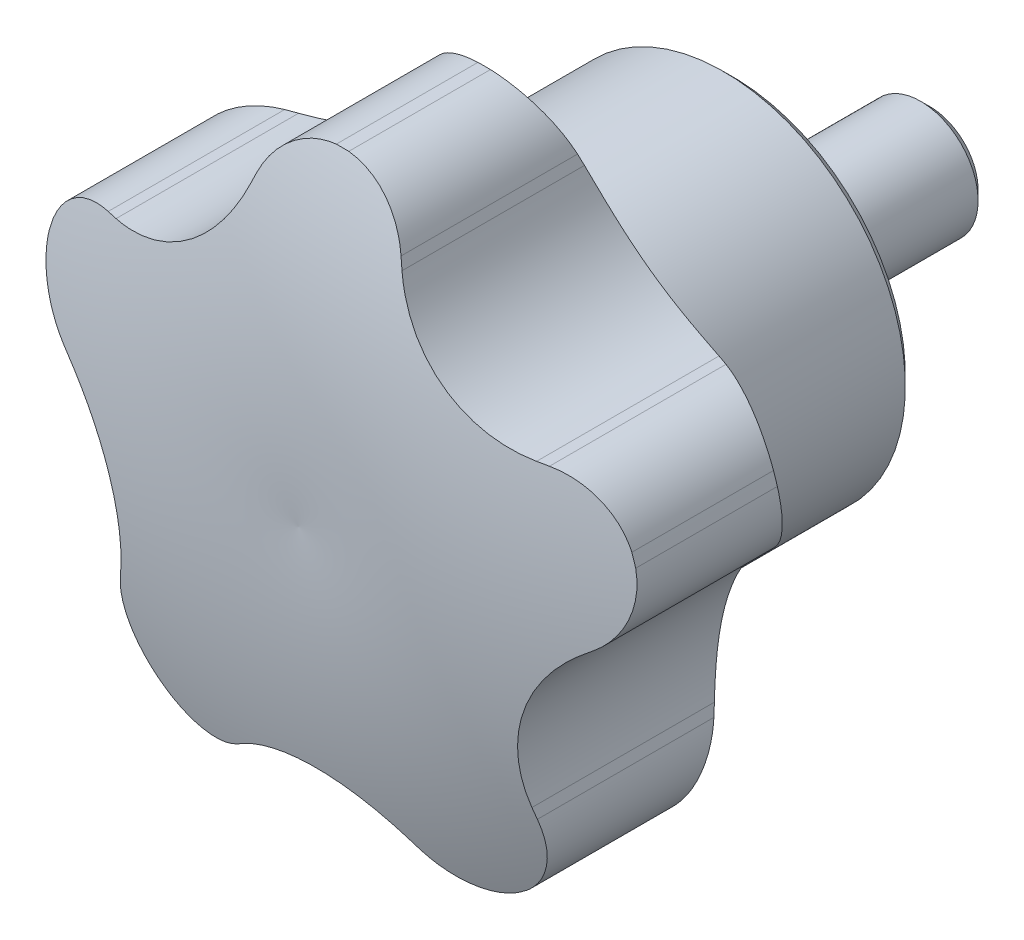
ISO-10303-21;
HEADER;
FILE_DESCRIPTION(('STEP AP214'),'2;1');
FILE_NAME('part.step','',(''),(''),'','','');
FILE_SCHEMA(('AUTOMOTIVE_DESIGN { 1 0 10303 214 1 1 1 1 }'));
ENDSEC;
DATA;
#1=APPLICATION_CONTEXT('core data for automotive mechanical design processes');
#2=APPLICATION_PROTOCOL_DEFINITION('international standard','automotive_design',2000,#1);
#3=PRODUCT_CONTEXT('',#1,'mechanical');
#4=PRODUCT('Part','Part','',(#3));
#5=PRODUCT_RELATED_PRODUCT_CATEGORY('part','',(#4));
#6=PRODUCT_DEFINITION_FORMATION('','',#4);
#7=PRODUCT_DEFINITION_CONTEXT('part definition',#1,'design');
#8=PRODUCT_DEFINITION('design','',#6,#7);
#9=PRODUCT_DEFINITION_SHAPE('','',#8);
#10=(LENGTH_UNIT() NAMED_UNIT(*) SI_UNIT(.MILLI.,.METRE.));
#11=(NAMED_UNIT(*) PLANE_ANGLE_UNIT() SI_UNIT($,.RADIAN.));
#12=(NAMED_UNIT(*) SI_UNIT($,.STERADIAN.) SOLID_ANGLE_UNIT());
#13=UNCERTAINTY_MEASURE_WITH_UNIT(LENGTH_MEASURE(1.E-05),#10,'distance_accuracy_value','');
#14=(GEOMETRIC_REPRESENTATION_CONTEXT(3) GLOBAL_UNCERTAINTY_ASSIGNED_CONTEXT((#13)) GLOBAL_UNIT_ASSIGNED_CONTEXT((#10,
#11,#12)) REPRESENTATION_CONTEXT('',''));
#15=CARTESIAN_POINT('',(0.,0.,0.));
#16=DIRECTION('',(0.,0.,1.));
#17=DIRECTION('',(1.,0.,0.));
#18=AXIS2_PLACEMENT_3D('',#15,#16,#17);
#19=CARTESIAN_POINT('',(0.,0.,0.));
#20=DIRECTION('',(0.,0.,-1.));
#21=DIRECTION('',(-1.,0.,0.));
#22=AXIS2_PLACEMENT_3D('',#19,#20,#21);
#23=CYLINDRICAL_SURFACE('',#22,16.);
#24=CARTESIAN_POINT('',(0.,0.,20.7));
#25=DIRECTION('',(0.,0.,-1.));
#26=DIRECTION('',(-1.,0.,0.));
#27=AXIS2_PLACEMENT_3D('',#24,#25,#26);
#28=CIRCLE('',#27,16.);
#29=CARTESIAN_POINT('',(-15.3145548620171,4.63296982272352,20.7));
#30=VERTEX_POINT('',#29);
#31=CARTESIAN_POINT('',(-15.1129264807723,5.25351817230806,20.7));
#32=VERTEX_POINT('',#31);
#33=EDGE_CURVE('E312',#30,#32,#28,.T.);
#34=ORIENTED_EDGE('',*,*,#33,.T.);
#35=DIRECTION('',(0.,0.,1.));
#36=VECTOR('',#35,1.);
#37=CARTESIAN_POINT('',(-15.1129264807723,5.25351817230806,0.));
#38=LINE('',#37,#36);
#39=CARTESIAN_POINT('',(-15.1129264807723,5.25351817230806,13.2999999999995));
#40=VERTEX_POINT('',#39);
#41=EDGE_CURVE('E592',#32,#40,#38,.F.);
#42=ORIENTED_EDGE('',*,*,#41,.T.);
#43=CARTESIAN_POINT('',(0.,0.,13.3));
#44=DIRECTION('',(0.,0.,-1.));
#45=DIRECTION('',(-1.,0.,0.));
#46=AXIS2_PLACEMENT_3D('',#43,#44,#45);
#47=CIRCLE('',#46,16.);
#48=CARTESIAN_POINT('',(-15.3145548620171,4.63296982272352,13.2999999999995));
#49=VERTEX_POINT('',#48);
#50=EDGE_CURVE('E309',#49,#40,#47,.T.);
#51=ORIENTED_EDGE('',*,*,#50,.F.);
#52=DIRECTION('',(0.,0.,1.));
#53=VECTOR('',#52,1.);
#54=CARTESIAN_POINT('',(-15.3145548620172,4.63296982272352,0.));
#55=LINE('',#54,#53);
#56=EDGE_CURVE('E584',#49,#30,#55,.T.);
#57=ORIENTED_EDGE('',*,*,#56,.T.);
#58=EDGE_LOOP('',(#34,#42,#51,#57));
#59=FACE_BOUND('',#58,.T.);
#60=ADVANCED_FACE('F14',(#59),#23,.T.);
#61=CARTESIAN_POINT('',(-9.1386738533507,-13.1333407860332,20.7));
#62=VERTEX_POINT('',#61);
#63=CARTESIAN_POINT('',(-9.66654380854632,-12.7498208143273,20.7));
#64=VERTEX_POINT('',#63);
#65=EDGE_CURVE('E322',#62,#64,#28,.T.);
#66=ORIENTED_EDGE('',*,*,#65,.T.);
#67=DIRECTION('',(0.,0.,1.));
#68=VECTOR('',#67,1.);
#69=CARTESIAN_POINT('',(-9.6665438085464,-12.7498208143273,0.));
#70=LINE('',#69,#68);
#71=CARTESIAN_POINT('',(-9.66654380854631,-12.7498208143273,13.2999999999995));
#72=VERTEX_POINT('',#71);
#73=EDGE_CURVE('E510',#64,#72,#70,.F.);
#74=ORIENTED_EDGE('',*,*,#73,.T.);
#75=CARTESIAN_POINT('',(-9.13867385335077,-13.1333407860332,13.2999999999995));
#76=VERTEX_POINT('',#75);
#77=EDGE_CURVE('E810',#76,#72,#47,.T.);
#78=ORIENTED_EDGE('',*,*,#77,.F.);
#79=DIRECTION('',(0.,0.,1.));
#80=VECTOR('',#79,1.);
#81=CARTESIAN_POINT('',(-9.13867385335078,-13.1333407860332,0.));
#82=LINE('',#81,#80);
#83=EDGE_CURVE('E502',#76,#62,#82,.T.);
#84=ORIENTED_EDGE('',*,*,#83,.T.);
#85=EDGE_LOOP('',(#66,#74,#78,#84));
#86=FACE_BOUND('',#85,.T.);
#87=ADVANCED_FACE('F835',(#86),#23,.T.);
#88=CARTESIAN_POINT('',(9.6665438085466,-12.7498208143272,20.7));
#89=VERTEX_POINT('',#88);
#90=CARTESIAN_POINT('',(9.13867385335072,-13.1333407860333,20.7));
#91=VERTEX_POINT('',#90);
#92=EDGE_CURVE('E320',#89,#91,#28,.T.);
#93=ORIENTED_EDGE('',*,*,#92,.T.);
#94=DIRECTION('',(0.,0.,1.));
#95=VECTOR('',#94,1.);
#96=CARTESIAN_POINT('',(9.13867385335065,-13.1333407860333,0.));
#97=LINE('',#96,#95);
#98=CARTESIAN_POINT('',(9.1386738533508,-13.1333407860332,13.2999999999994));
#99=VERTEX_POINT('',#98);
#100=EDGE_CURVE('E339',#91,#99,#97,.F.);
#101=ORIENTED_EDGE('',*,*,#100,.T.);
#102=CARTESIAN_POINT('',(9.66654380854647,-12.7498208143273,13.2999999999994));
#103=VERTEX_POINT('',#102);
#104=EDGE_CURVE('E812',#103,#99,#47,.T.);
#105=ORIENTED_EDGE('',*,*,#104,.F.);
#106=DIRECTION('',(0.,0.,1.));
#107=VECTOR('',#106,1.);
#108=CARTESIAN_POINT('',(9.66654380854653,-12.7498208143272,0.));
#109=LINE('',#108,#107);
#110=EDGE_CURVE('E341',#103,#89,#109,.T.);
#111=ORIENTED_EDGE('',*,*,#110,.T.);
#112=EDGE_LOOP('',(#93,#101,#105,#111));
#113=FACE_BOUND('',#112,.T.);
#114=ADVANCED_FACE('F337',(#113),#23,.T.);
#115=CARTESIAN_POINT('',(-0.326241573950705,15.9966736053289,20.7));
#116=VERTEX_POINT('',#115);
#117=CARTESIAN_POINT('',(0.326241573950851,15.9966736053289,20.7));
#118=VERTEX_POINT('',#117);
#119=EDGE_CURVE('E232',#116,#118,#28,.T.);
#120=ORIENTED_EDGE('',*,*,#119,.T.);
#121=DIRECTION('',(0.,0.,1.));
#122=VECTOR('',#121,1.);
#123=CARTESIAN_POINT('',(0.326241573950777,15.9966736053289,0.));
#124=LINE('',#123,#122);
#125=CARTESIAN_POINT('',(0.326241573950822,15.9966736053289,13.2999999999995));
#126=VERTEX_POINT('',#125);
#127=EDGE_CURVE('E671',#118,#126,#124,.F.);
#128=ORIENTED_EDGE('',*,*,#127,.T.);
#129=CARTESIAN_POINT('',(-0.326241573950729,15.9966736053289,13.2999999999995));
#130=VERTEX_POINT('',#129);
#131=EDGE_CURVE('E310',#130,#126,#47,.T.);
#132=ORIENTED_EDGE('',*,*,#131,.F.);
#133=DIRECTION('',(0.,0.,1.));
#134=VECTOR('',#133,1.);
#135=CARTESIAN_POINT('',(-0.326241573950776,15.9966736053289,0.));
#136=LINE('',#135,#134);
#137=EDGE_CURVE('E662',#130,#116,#136,.T.);
#138=ORIENTED_EDGE('',*,*,#137,.T.);
#139=EDGE_LOOP('',(#120,#128,#132,#138));
#140=FACE_BOUND('',#139,.T.);
#141=ADVANCED_FACE('F790',(#140),#23,.T.);
#142=CARTESIAN_POINT('',(-2.59665404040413,0.,-15.7384936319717));
#143=DIRECTION('',(0.,-1.,0.));
#144=DIRECTION('',(-1.,0.,0.));
#145=AXIS2_PLACEMENT_3D('',#142,#143,#144);
#146=CIRCLE('',#145,38.8254233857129);
#147=TRIMMED_CURVE('',#146,(PARAMETER_VALUE(-1.63772653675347)),
(PARAMETER_VALUE(1.63772653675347)),.T.,.PARAMETER.);
#148=CARTESIAN_POINT('',(0.,0.,-15.7384936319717));
#149=DIRECTION('',(0.,0.,-1.));
#150=AXIS1_PLACEMENT('',#148,#149);
#151=SURFACE_OF_REVOLUTION('',#147,#150);
#152=CARTESIAN_POINT('',(0.,0.,23.));
#153=VERTEX_POINT('',#152);
#154=VERTEX_LOOP('',#153);
#155=FACE_BOUND('',#154,.T.);
#156=CARTESIAN_POINT('',(-3.77099647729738,13.3440110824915,21.415260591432));
#157=CARTESIAN_POINT('',(-3.73320410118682,13.4508726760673,21.3871864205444));
#158=CARTESIAN_POINT('',(-3.69082482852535,13.5561957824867,21.3594189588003));
#159=CARTESIAN_POINT('',(-3.59717795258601,13.7630488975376,21.3047121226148));
#160=CARTESIAN_POINT('',(-3.54590951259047,13.8645785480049,21.277772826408));
#161=CARTESIAN_POINT('',(-3.43474465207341,14.0631659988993,21.2249269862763));
#162=CARTESIAN_POINT('',(-3.37484322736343,14.1602211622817,21.1990210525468));
#163=CARTESIAN_POINT('',(-3.24680122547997,14.3490799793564,21.1484760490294));
#164=CARTESIAN_POINT('',(-3.17866104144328,14.4408838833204,21.1238369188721));
#165=CARTESIAN_POINT('',(-3.03449158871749,14.6186333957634,21.0760148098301));
#166=CARTESIAN_POINT('',(-2.95845492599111,14.7045733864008,21.0528332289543));
#167=CARTESIAN_POINT('',(-2.79900496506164,14.869853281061,21.0081525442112));
#168=CARTESIAN_POINT('',(-2.71558910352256,14.9491908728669,20.9866540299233));
#169=CARTESIAN_POINT('',(-2.54199733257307,15.1005508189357,20.9455591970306));
#170=CARTESIAN_POINT('',(-2.45182452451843,15.1725764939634,20.9259620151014));
#171=CARTESIAN_POINT('',(-2.26530938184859,15.3087428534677,20.8888498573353));
#172=CARTESIAN_POINT('',(-2.16896729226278,15.3728838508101,20.8713347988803));
#173=CARTESIAN_POINT('',(-1.97314202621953,15.4913062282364,20.8389499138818));
#174=CARTESIAN_POINT('',(-1.87378667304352,15.5457846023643,20.8240274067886));
#175=CARTESIAN_POINT('',(-1.6705909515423,15.6462016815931,20.7964888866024));
#176=CARTESIAN_POINT('',(-1.56675241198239,15.6921438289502,20.7838719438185));
#177=CARTESIAN_POINT('',(-1.35541384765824,15.7750666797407,20.7610775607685));
#178=CARTESIAN_POINT('',(-1.24791739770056,15.8120558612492,20.7508978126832));
#179=CARTESIAN_POINT('',(-1.03001609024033,15.8767784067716,20.7330730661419));
#180=CARTESIAN_POINT('',(-0.919612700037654,15.9045163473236,20.7254268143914));
#181=CARTESIAN_POINT('',(-0.72716441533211,15.9442185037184,20.7144774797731));
#182=CARTESIAN_POINT('',(-0.645608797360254,15.9584217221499,20.7105585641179));
#183=CARTESIAN_POINT('',(-0.481866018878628,15.9817298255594,20.7041258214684));
#184=CARTESIAN_POINT('',(-0.399680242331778,15.9908437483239,20.7016095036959));
#185=CARTESIAN_POINT('',(-0.317265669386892,15.9973979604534,20.6998));
#186=B_SPLINE_CURVE_WITH_KNOTS('',3,(#156,#157,#158,#159,#160,#161,#162,#163,#164,#165,#166,
#167,#168,#169,#170,#171,#172,#173,#174,#175,#176,#177,#178,#179,#180,#181,#182,#183,#184,#185),
.UNSPECIFIED.,.F.,.F.,(4,2,2,2,2,2,2,2,2,2,2,2,2,2,4),(0.,0.350222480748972,0.700477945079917,
1.05093726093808,1.40137986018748,1.75215361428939,2.10304969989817,2.45378570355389,
2.80450778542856,3.14695123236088,3.48925628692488,3.83123591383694,4.17304611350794,
4.42151117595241,4.66953358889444),.UNSPECIFIED.);
#187=CARTESIAN_POINT('',(-3.77092572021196,13.3442110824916,21.4152080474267));
#188=VERTEX_POINT('',#187);
#189=EDGE_CURVE('E664',#188,#116,#186,.T.);
#190=ORIENTED_EDGE('',*,*,#189,.F.);
#191=CARTESIAN_POINT('',(-3.95260918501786,12.8307129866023,21.5461485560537));
#192=CARTESIAN_POINT('',(-3.92226680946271,12.9164706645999,21.5249399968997));
#193=CARTESIAN_POINT('',(-3.89194943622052,13.0021576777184,21.5034196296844));
#194=CARTESIAN_POINT('',(-3.83136469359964,13.1733903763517,21.4597552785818));
#195=CARTESIAN_POINT('',(-3.8010973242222,13.258936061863,21.4376112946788));
#196=CARTESIAN_POINT('',(-3.77085495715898,13.3444110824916,21.415155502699));
#197=B_SPLINE_CURVE_WITH_KNOTS('',3,(#191,#192,#193,#194,#195,#196),.UNSPECIFIED.,.F.,.F.,(4,2,
4),(0.,0.280215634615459,0.560431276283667),.UNSPECIFIED.);
#198=CARTESIAN_POINT('',(-3.9525384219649,12.8309129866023,21.5460990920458));
#199=VERTEX_POINT('',#198);
#200=EDGE_CURVE('E651',#199,#188,#197,.T.);
#201=ORIENTED_EDGE('',*,*,#200,.F.);
#202=CARTESIAN_POINT('',(-3.95246766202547,12.8311129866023,21.5460496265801));
#203=CARTESIAN_POINT('',(-4.01935057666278,12.6419853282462,21.5928356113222));
#204=CARTESIAN_POINT('',(-4.093930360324,12.454862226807,21.6367985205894));
#205=CARTESIAN_POINT('',(-4.25814425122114,12.0859801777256,21.7188765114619));
#206=CARTESIAN_POINT('',(-4.34778093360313,11.9042221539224,21.7569905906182));
#207=CARTESIAN_POINT('',(-4.54179627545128,11.5473986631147,21.8271712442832));
#208=CARTESIAN_POINT('',(-4.64618254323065,11.3723367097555,21.859234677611));
#209=CARTESIAN_POINT('',(-4.86909539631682,11.030392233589,21.9171386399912));
#210=CARTESIAN_POINT('',(-4.9876208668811,10.8635090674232,21.9429796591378));
#211=CARTESIAN_POINT('',(-5.23830361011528,10.5389870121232,21.988369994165));
#212=CARTESIAN_POINT('',(-5.3704814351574,10.3813626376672,22.0079096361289));
#213=CARTESIAN_POINT('',(-5.64745186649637,10.0768963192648,22.0405756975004));
#214=CARTESIAN_POINT('',(-5.79224454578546,9.93005443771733,22.0537020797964));
#215=CARTESIAN_POINT('',(-6.09330700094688,9.64843857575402,22.0734952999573));
#216=CARTESIAN_POINT('',(-6.24956704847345,9.5136545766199,22.0801675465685));
#217=CARTESIAN_POINT('',(-6.57253039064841,9.25706710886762,22.0870549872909));
#218=CARTESIAN_POINT('',(-6.7392333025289,9.13526316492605,22.0872704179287));
#219=CARTESIAN_POINT('',(-7.07799217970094,8.90812281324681,22.0813121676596));
#220=CARTESIAN_POINT('',(-7.2498442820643,8.80247838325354,22.0752816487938));
#221=CARTESIAN_POINT('',(-7.60108680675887,8.60518068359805,22.0570643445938));
#222=CARTESIAN_POINT('',(-7.78047715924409,8.51352728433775,22.0448776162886));
#223=CARTESIAN_POINT('',(-8.14556763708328,8.34474401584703,22.0143736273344));
#224=CARTESIAN_POINT('',(-8.33127092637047,8.26762155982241,21.9960532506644));
#225=CARTESIAN_POINT('',(-8.70752265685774,8.1283893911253,21.953343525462));
#226=CARTESIAN_POINT('',(-8.8980704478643,8.06627767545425,21.9289549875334));
#227=CARTESIAN_POINT('',(-9.2455117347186,7.96784147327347,21.8794896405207));
#228=CARTESIAN_POINT('',(-9.40180657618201,7.92885382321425,21.8554531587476));
#229=CARTESIAN_POINT('',(-9.71593106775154,7.86088893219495,21.8035583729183));
#230=CARTESIAN_POINT('',(-9.87376067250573,7.83191139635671,21.7757001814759));
#231=CARTESIAN_POINT('',(-10.1899340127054,7.78402260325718,21.7163039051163));
#232=CARTESIAN_POINT('',(-10.3482762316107,7.76509259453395,21.6847728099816));
#233=CARTESIAN_POINT('',(-10.6650823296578,7.7371501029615,21.6180962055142));
#234=CARTESIAN_POINT('',(-10.8235462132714,7.72813800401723,21.5829505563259));
#235=CARTESIAN_POINT('',(-10.981721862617,7.72405240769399,21.5460524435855));
#236=B_SPLINE_CURVE_WITH_KNOTS('',3,(#202,#203,#204,#205,#206,#207,#208,#209,#210,#211,#212,
#213,#214,#215,#216,#217,#218,#219,#220,#221,#222,#223,#224,#225,#226,#227,#228,#229,#230,#231,
#232,#233,#234,#235),.UNSPECIFIED.,.F.,.F.,(4,2,2,2,2,2,2,2,2,2,2,2,2,2,2,2,4),(0.,
0.617822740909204,1.23575125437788,1.85399968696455,2.47219940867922,3.0913437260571,
3.71049162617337,4.32912021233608,4.94772613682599,5.55246035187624,6.15718896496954,
6.76222526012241,7.36718077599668,7.85543723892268,8.34367931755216,8.83100696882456,
9.31835348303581),.UNSPECIFIED.);
#237=CARTESIAN_POINT('',(-10.981521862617,7.72405758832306,21.5460990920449));
#238=VERTEX_POINT('',#237);
#239=EDGE_CURVE('E643',#199,#238,#236,.T.);
#240=ORIENTED_EDGE('',*,*,#239,.T.);
#241=CARTESIAN_POINT('',(-11.5260187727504,7.70994629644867,21.4151584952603));
#242=CARTESIAN_POINT('',(-11.4353858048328,7.71229515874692,21.4376132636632));
#243=CARTESIAN_POINT('',(-11.3446779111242,7.71464596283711,21.4597562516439));
#244=CARTESIAN_POINT('',(-11.1631122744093,7.71935145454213,21.5034186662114));
#245=CARTESIAN_POINT('',(-11.0722545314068,7.72170614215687,21.5249380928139));
#246=CARTESIAN_POINT('',(-10.981321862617,7.72406277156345,21.54614573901));
#247=B_SPLINE_CURVE_WITH_KNOTS('',3,(#241,#242,#243,#244,#245,#246),.UNSPECIFIED.,.F.,.F.,(4,2,
4),(0.,0.280203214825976,0.560406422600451),.UNSPECIFIED.);
#248=CARTESIAN_POINT('',(-11.5258187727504,7.70995147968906,21.4152080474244));
#249=VERTEX_POINT('',#248);
#250=EDGE_CURVE('E652',#249,#238,#247,.T.);
#251=ORIENTED_EDGE('',*,*,#250,.F.);
#252=CARTESIAN_POINT('',(-15.1163890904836,5.24520541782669,20.6998));
#253=CARTESIAN_POINT('',(-15.0741587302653,5.34694466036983,20.7022082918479));
#254=CARTESIAN_POINT('',(-15.0277158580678,5.44689641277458,20.7058758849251));
#255=CARTESIAN_POINT('',(-14.9268181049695,5.64252631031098,20.7156733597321));
#256=CARTESIAN_POINT('',(-14.8723644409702,5.73820510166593,20.7218028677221));
#257=CARTESIAN_POINT('',(-14.7559576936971,5.92444153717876,20.7364544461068));
#258=CARTESIAN_POINT('',(-14.6940193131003,6.0150087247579,20.7449718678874));
#259=CARTESIAN_POINT('',(-14.5630725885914,6.19058003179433,20.7643130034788));
#260=CARTESIAN_POINT('',(-14.4940641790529,6.27558409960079,20.7751367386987));
#261=CARTESIAN_POINT('',(-14.2772082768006,6.52136213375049,20.8109202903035));
#262=CARTESIAN_POINT('',(-14.1194134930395,6.67308773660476,20.839207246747));
#263=CARTESIAN_POINT('',(-13.7822732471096,6.94817964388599,20.9035773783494));
#264=CARTESIAN_POINT('',(-13.6029206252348,7.07153648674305,20.9396631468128));
#265=CARTESIAN_POINT('',(-13.2240833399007,7.28925783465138,21.0191498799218));
#266=CARTESIAN_POINT('',(-13.0242746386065,7.38301095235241,21.0626796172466));
#267=CARTESIAN_POINT('',(-12.6131370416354,7.53617382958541,21.1550869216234));
#268=CARTESIAN_POINT('',(-12.4018144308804,7.5956021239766,21.2039615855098));
#269=CARTESIAN_POINT('',(-12.0782654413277,7.65870241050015,21.280639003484));
#270=CARTESIAN_POINT('',(-11.968101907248,7.67542891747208,21.3070616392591));
#271=CARTESIAN_POINT('',(-11.747194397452,7.69961177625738,21.3606418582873));
#272=CARTESIAN_POINT('',(-11.6364521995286,7.70708816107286,21.3877977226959));
#273=CARTESIAN_POINT('',(-11.5256187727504,7.70995665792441,21.4152575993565));
#274=B_SPLINE_CURVE_WITH_KNOTS('',3,(#252,#253,#254,#255,#256,#257,#258,#259,#260,#261,#262,
#263,#264,#265,#266,#267,#268,#269,#270,#271,#272,#273),.UNSPECIFIED.,.F.,.F.,(4,2,2,2,2,2,2,2,
2,2,4),(0.,0.330431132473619,0.660812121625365,0.990554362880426,1.32029966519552,
1.97913896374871,2.63819768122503,3.31009108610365,3.98162133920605,4.32484055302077,
4.66731514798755),.UNSPECIFIED.);
#275=EDGE_CURVE('E802',#32,#249,#274,.T.);
#276=ORIENTED_EDGE('',*,*,#275,.F.);
#277=ORIENTED_EDGE('',*,*,#33,.F.);
#278=CARTESIAN_POINT('',(-13.8561182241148,0.537024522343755,21.4152894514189));
#279=CARTESIAN_POINT('',(-13.9460733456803,0.605986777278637,21.387215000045));
#280=CARTESIAN_POINT('',(-14.0331479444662,0.678836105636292,21.3594472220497));
#281=CARTESIAN_POINT('',(-14.2009432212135,0.831816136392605,21.3047396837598));
#282=CARTESIAN_POINT('',(-14.2816633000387,0.911947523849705,21.277800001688));
#283=CARTESIAN_POINT('',(-14.4361844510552,1.07903433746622,21.2249533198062));
#284=CARTESIAN_POINT('',(-14.5099814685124,1.16599370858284,21.1990469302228));
#285=CARTESIAN_POINT('',(-14.6500351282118,1.34612577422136,21.1485009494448));
#286=CARTESIAN_POINT('',(-14.716292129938,1.43929817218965,21.123861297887));
#287=CARTESIAN_POINT('',(-14.8407968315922,1.63133585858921,21.0760380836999));
#288=CARTESIAN_POINT('',(-14.8990369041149,1.73020644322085,21.0528559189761));
#289=CARTESIAN_POINT('',(-15.0069606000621,1.93292392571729,21.008174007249));
#290=CARTESIAN_POINT('',(-15.0566412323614,2.03677254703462,20.9866748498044));
#291=CARTESIAN_POINT('',(-15.1469564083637,2.24863870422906,20.9455786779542));
#292=CARTESIAN_POINT('',(-15.187595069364,2.35665431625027,20.9259808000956));
#293=CARTESIAN_POINT('',(-15.2594669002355,2.57611679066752,20.8888672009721));
#294=CARTESIAN_POINT('',(-15.2907004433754,2.6875635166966,20.8713513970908));
#295=CARTESIAN_POINT('',(-15.3428198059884,2.9103978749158,20.8389649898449));
#296=CARTESIAN_POINT('',(-15.3639324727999,3.02172480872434,20.8240417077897));
#297=CARTESIAN_POINT('',(-15.3966501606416,3.24600555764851,20.7965016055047));
#298=CARTESIAN_POINT('',(-15.4082590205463,3.35895869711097,20.7838838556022));
#299=CARTESIAN_POINT('',(-15.4218224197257,3.58557832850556,20.7610878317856));
#300=CARTESIAN_POINT('',(-15.4237861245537,3.69924404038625,20.750907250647));
#301=CARTESIAN_POINT('',(-15.4180119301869,3.92648160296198,20.733080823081));
#302=CARTESIAN_POINT('',(-15.4102788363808,4.04005347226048,20.7254337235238));
#303=CARTESIAN_POINT('',(-15.3885713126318,4.23537020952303,20.7144819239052));
#304=CARTESIAN_POINT('',(-15.3768764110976,4.31734145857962,20.7105616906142));
#305=CARTESIAN_POINT('',(-15.3484404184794,4.48030878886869,20.7041269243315));
#306=CARTESIAN_POINT('',(-15.33170835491,4.56130634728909,20.7016098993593));
#307=CARTESIAN_POINT('',(-15.3124700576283,4.64173025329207,20.6998));
#308=B_SPLINE_CURVE_WITH_KNOTS('',3,(#278,#279,#280,#281,#282,#283,#284,#285,#286,#287,#288,
#289,#290,#291,#292,#293,#294,#295,#296,#297,#298,#299,#300,#301,#302,#303,#304,#305,#306,#307),
.UNSPECIFIED.,.F.,.F.,(4,2,2,2,2,2,2,2,2,2,2,2,2,2,4),(0.,0.350223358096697,0.700479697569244,
1.05093991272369,1.40138341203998,1.75215805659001,2.10305503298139,2.45379189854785,
2.80451484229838,3.14695926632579,3.48926529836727,3.83124598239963,4.17305725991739,
4.42157679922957,4.66965357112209),.UNSPECIFIED.);
#309=CARTESIAN_POINT('',(-13.8563790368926,0.537224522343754,21.4152080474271));
#310=VERTEX_POINT('',#309);
#311=EDGE_CURVE('E586',#310,#30,#308,.T.);
#312=ORIENTED_EDGE('',*,*,#311,.F.);
#313=CARTESIAN_POINT('',(-13.4241249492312,0.205729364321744,21.5461578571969));
#314=CARTESIAN_POINT('',(-13.4963196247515,0.261095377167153,21.5249462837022));
#315=CARTESIAN_POINT('',(-13.5684548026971,0.316415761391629,21.5034228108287));
#316=CARTESIAN_POINT('',(-13.7126061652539,0.426965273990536,21.459752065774));
#317=CARTESIAN_POINT('',(-13.7846223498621,0.48219440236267,21.4376047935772));
#318=CARTESIAN_POINT('',(-13.8565790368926,0.537377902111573,21.4151456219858));
#319=B_SPLINE_CURVE_WITH_KNOTS('',3,(#313,#314,#315,#316,#317,#318),.UNSPECIFIED.,.F.,.F.,(4,2,
4),(0.,0.280256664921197,0.560513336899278),.UNSPECIFIED.);
#320=CARTESIAN_POINT('',(-13.4243249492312,0.205882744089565,21.5460990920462));
#321=VERTEX_POINT('',#320);
#322=EDGE_CURVE('E573',#321,#310,#319,.T.);
#323=ORIENTED_EDGE('',*,*,#322,.F.);
#324=CARTESIAN_POINT('',(-13.4245249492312,0.206036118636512,21.546040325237));
#325=CARTESIAN_POINT('',(-13.265321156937,0.0839838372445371,21.5928267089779));
#326=CARTESIAN_POINT('',(-13.1104022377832,-0.0447691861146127,21.6367900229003));
#327=CARTESIAN_POINT('',(-12.8103179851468,-0.314935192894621,21.7188688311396));
#328=CARTESIAN_POINT('',(-12.66515432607,-0.456350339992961,21.7569833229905));
#329=CARTESIAN_POINT('',(-12.3857474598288,-0.751133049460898,21.8271648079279));
#330=CARTESIAN_POINT('',(-12.2515099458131,-0.904506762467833,21.8592286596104));
#331=CARTESIAN_POINT('',(-11.9951835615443,-1.22217492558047,21.9171334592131));
#332=CARTESIAN_POINT('',(-11.8730937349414,-1.38646851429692,21.9429748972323));
#333=CARTESIAN_POINT('',(-11.6419183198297,-1.72516375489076,21.9883660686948));
#334=CARTESIAN_POINT('',(-11.5328528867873,-1.89958046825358,22.0079061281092));
#335=CARTESIAN_POINT('',(-11.3288748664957,-2.2570794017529,22.0405730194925));
#336=CARTESIAN_POINT('',(-11.2339623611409,-2.44016167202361,22.0536998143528));
#337=CARTESIAN_POINT('',(-11.0591612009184,-2.81351248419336,22.0734938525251));
#338=CARTESIAN_POINT('',(-10.9792600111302,-3.00377486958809,22.0801665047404));
#339=CARTESIAN_POINT('',(-10.8350299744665,-3.3902206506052,22.0870547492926));
#340=CARTESIAN_POINT('',(-10.7707005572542,-3.58640382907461,22.0872705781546));
#341=CARTESIAN_POINT('',(-10.6593575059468,-3.97877251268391,22.0813131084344));
#342=CARTESIAN_POINT('',(-10.611987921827,-4.17485931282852,22.0752829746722));
#343=CARTESIAN_POINT('',(-10.5328845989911,-4.56987886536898,22.0570664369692));
#344=CARTESIAN_POINT('',(-10.501150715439,-4.768811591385,22.0448800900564));
#345=CARTESIAN_POINT('',(-10.453445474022,-5.16819007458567,22.0143768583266));
#346=CARTESIAN_POINT('',(-10.4374821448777,-5.36863655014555,21.9960568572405));
#347=CARTESIAN_POINT('',(-10.4213307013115,-5.76949841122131,21.9533478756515));
#348=CARTESIAN_POINT('',(-10.4211404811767,-5.96991379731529,21.9289597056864));
#349=CARTESIAN_POINT('',(-10.4348857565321,-6.33077257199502,21.8794944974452));
#350=CARTESIAN_POINT('',(-10.4461036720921,-6.49146953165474,21.8554576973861));
#351=CARTESIAN_POINT('',(-10.4785347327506,-6.81122971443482,21.8035620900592));
#352=CARTESIAN_POINT('',(-10.4997475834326,-6.97029298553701,21.7757033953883));
#353=CARTESIAN_POINT('',(-10.5519062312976,-7.28579775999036,21.7163059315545));
#354=CARTESIAN_POINT('',(-10.5828337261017,-7.44224361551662,21.6847741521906));
#355=CARTESIAN_POINT('',(-10.6541588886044,-7.75218620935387,21.618096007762));
#356=CARTESIAN_POINT('',(-10.6945569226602,-7.90568283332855,21.5829495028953));
#357=CARTESIAN_POINT('',(-10.7395514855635,-8.05738286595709,21.5460504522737));
#358=B_SPLINE_CURVE_WITH_KNOTS('',3,(#324,#325,#326,#327,#328,#329,#330,#331,#332,#333,#334,
#335,#336,#337,#338,#339,#340,#341,#342,#343,#344,#345,#346,#347,#348,#349,#350,#351,#352,#353,
#354,#355,#356,#357),.UNSPECIFIED.,.F.,.F.,(4,2,2,2,2,2,2,2,2,2,2,2,2,2,2,2,4),(0.,
0.617823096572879,1.23575196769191,1.85400078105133,2.47220088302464,3.09134559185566,
3.71049388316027,4.32912284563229,4.94772914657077,5.55246347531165,6.15719220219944,
6.76222863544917,7.36718429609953,7.85545229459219,8.34370591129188,8.83104512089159,
9.31840318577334),.UNSPECIFIED.);
#359=CARTESIAN_POINT('',(-10.7394921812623,-8.05718286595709,21.5460990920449));
#360=VERTEX_POINT('',#359);
#361=EDGE_CURVE('E565',#321,#360,#358,.T.);
#362=ORIENTED_EDGE('',*,*,#361,.T.);
#363=CARTESIAN_POINT('',(-10.8943327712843,-8.57939901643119,21.4151563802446));
#364=CARTESIAN_POINT('',(-10.8685587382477,-8.4924733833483,21.4376118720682));
#365=CARTESIAN_POINT('',(-10.8427633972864,-8.40547588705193,21.4597555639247));
#366=CARTESIAN_POINT('',(-10.7911301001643,-8.23133717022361,21.5034193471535));
#367=CARTESIAN_POINT('',(-10.7652921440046,-8.14419594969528,21.5249394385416));
#368=CARTESIAN_POINT('',(-10.7394328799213,-8.05698286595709,21.5461477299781));
#369=B_SPLINE_CURVE_WITH_KNOTS('',3,(#363,#364,#365,#366,#367,#368),.UNSPECIFIED.,.F.,.F.,(4,2,
4),(0.,0.280211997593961,0.56042398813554),.UNSPECIFIED.);
#370=CARTESIAN_POINT('',(-10.8942734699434,-8.57919901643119,21.4152080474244));
#371=VERTEX_POINT('',#370);
#372=EDGE_CURVE('E574',#371,#360,#369,.T.);
#373=ORIENTED_EDGE('',*,*,#372,.F.);
#374=CARTESIAN_POINT('',(-9.6597079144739,-12.7556827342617,20.6998));
#375=CARTESIAN_POINT('',(-9.74341778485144,-12.6840801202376,20.7022082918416));
#376=CARTESIAN_POINT('',(-9.82412591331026,-12.6090235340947,20.7058758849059));
#377=CARTESIAN_POINT('',(-9.97900188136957,-12.4526111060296,20.715673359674));
#378=CARTESIAN_POINT('',(-10.0531707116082,-12.3712562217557,20.7218028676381));
#379=CARTESIAN_POINT('',(-10.19432042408,-12.2029966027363,20.7364544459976));
#380=CARTESIAN_POINT('',(-10.2613149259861,-12.1161029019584,20.7449718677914));
#381=CARTESIAN_POINT('',(-10.38782839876,-11.9373106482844,20.7643130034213));
#382=CARTESIAN_POINT('',(-10.4473473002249,-11.8454120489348,20.7751367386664));
#383=CARTESIAN_POINT('',(-10.6140839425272,-11.5632202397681,20.8109202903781));
#384=CARTESIAN_POINT('',(-10.7096222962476,-11.3662626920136,20.8392072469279));
#385=CARTESIAN_POINT('',(-10.8670681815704,-10.9606151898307,20.9035773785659));
#386=CARTESIAN_POINT('',(-10.9289645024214,-10.7519213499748,20.9396631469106));
#387=CARTESIAN_POINT('',(-11.018962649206,-10.3243460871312,21.0191498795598));
#388=CARTESIAN_POINT('',(-11.0463828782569,-10.1053454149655,21.0626796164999));
#389=CARTESIAN_POINT('',(-11.0650009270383,-9.66700039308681,21.1550869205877));
#390=CARTESIAN_POINT('',(-11.0562183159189,-9.44765629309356,21.2039615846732));
#391=CARTESIAN_POINT('',(-11.0162479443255,-9.12044243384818,21.2806393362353));
#392=CARTESIAN_POINT('',(-10.9981131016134,-9.01050051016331,21.3070623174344));
#393=CARTESIAN_POINT('',(-10.9528473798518,-8.79292933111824,21.3606432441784));
#394=CARTESIAN_POINT('',(-10.9257361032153,-8.68529557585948,21.3877994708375));
#395=CARTESIAN_POINT('',(-10.8942141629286,-8.57899901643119,21.4152597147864));
#396=B_SPLINE_CURVE_WITH_KNOTS('',3,(#374,#375,#376,#377,#378,#379,#380,#381,#382,#383,#384,
#385,#386,#387,#388,#389,#390,#391,#392,#393,#394,#395),.UNSPECIFIED.,.F.,.F.,(4,2,2,2,2,2,2,2,
2,2,4),(0.,0.33043113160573,0.660812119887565,0.990554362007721,1.32029966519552,
1.97913896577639,2.63819768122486,3.31009107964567,3.98162133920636,4.32484495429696,
4.66732393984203),.UNSPECIFIED.);
#397=EDGE_CURVE('E1143',#64,#371,#396,.T.);
#398=ORIENTED_EDGE('',*,*,#397,.F.);
#399=ORIENTED_EDGE('',*,*,#65,.F.);
#400=CARTESIAN_POINT('',(-4.79258748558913,-13.0120505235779,21.4152681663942));
#401=CARTESIAN_POINT('',(-4.88597338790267,-13.0762903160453,21.3871939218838));
#402=CARTESIAN_POINT('',(-4.98216589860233,-13.1365893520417,21.3594263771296));
#403=CARTESIAN_POINT('',(-5.17951226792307,-13.2488943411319,21.3047193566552));
#404=CARTESIAN_POINT('',(-5.28066659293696,-13.3008995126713,21.2777799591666));
#405=CARTESIAN_POINT('',(-5.48732700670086,-13.3962206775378,21.2249338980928));
#406=CARTESIAN_POINT('',(-5.59283559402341,-13.4395315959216,21.1990278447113));
#407=CARTESIAN_POINT('',(-5.80743169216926,-13.517062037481,21.1484825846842));
#408=CARTESIAN_POINT('',(-5.9165190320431,-13.5512819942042,21.1238433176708));
#409=CARTESIAN_POINT('',(-6.13763276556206,-13.610345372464,21.0760209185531));
#410=CARTESIAN_POINT('',(-6.24966183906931,-13.6351799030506,21.0528391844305));
#411=CARTESIAN_POINT('',(-6.47580844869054,-13.6751735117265,21.0081581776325));
#412=CARTESIAN_POINT('',(-6.58992669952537,-13.6903292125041,20.986659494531));
#413=CARTESIAN_POINT('',(-6.81933247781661,-13.710749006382,20.9455643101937));
#414=CARTESIAN_POINT('',(-6.93461944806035,-13.7160176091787,20.9259669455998));
#415=CARTESIAN_POINT('',(-7.16555003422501,-13.7165493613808,20.8888544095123));
#416=CARTESIAN_POINT('',(-7.28119363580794,-13.7118129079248,20.8713391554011));
#417=CARTESIAN_POINT('',(-7.50922677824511,-13.6925170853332,20.8389538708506));
#418=CARTESIAN_POINT('',(-7.62162869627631,-13.6781922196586,20.8240311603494));
#419=CARTESIAN_POINT('',(-7.84504156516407,-13.6399975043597,20.7964922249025));
#420=CARTESIAN_POINT('',(-7.95605305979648,-13.6161315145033,20.7838750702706));
#421=CARTESIAN_POINT('',(-8.17577092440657,-13.5589973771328,20.7610802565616));
#422=CARTESIAN_POINT('',(-8.28447938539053,-13.5257381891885,20.7509002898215));
#423=CARTESIAN_POINT('',(-8.49880889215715,-13.4500221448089,20.7330751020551));
#424=CARTESIAN_POINT('',(-8.60443144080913,-13.4075698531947,20.7254286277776));
#425=CARTESIAN_POINT('',(-8.78346669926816,-13.3265705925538,20.7144786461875));
#426=CARTESIAN_POINT('',(-8.85779949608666,-13.2901223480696,20.7105593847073));
#427=CARTESIAN_POINT('',(-9.00397903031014,-13.2127294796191,20.704126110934));
#428=CARTESIAN_POINT('',(-9.07582996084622,-13.1717929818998,20.7016096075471));
#429=CARTESIAN_POINT('',(-9.14636127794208,-13.1286508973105,20.6998));
#430=B_SPLINE_CURVE_WITH_KNOTS('',3,(#400,#401,#402,#403,#404,#405,#406,#407,#408,#409,#410,
#411,#412,#413,#414,#415,#416,#417,#418,#419,#420,#421,#422,#423,#424,#425,#426,#427,#428,#429),
.UNSPECIFIED.,.F.,.F.,(4,2,2,2,2,2,2,2,2,2,2,2,2,2,4),(0.,0.35022271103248,0.700478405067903,
1.05093795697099,1.40138079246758,1.75215478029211,2.10305109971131,2.45378732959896,
2.80450963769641,3.14695334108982,3.48925865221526,3.83123855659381,4.17304903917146,
4.42152840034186,4.66956508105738),.UNSPECIFIED.);
#431=CARTESIAN_POINT('',(-4.79278748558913,-13.0121880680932,21.415208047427));
#432=VERTEX_POINT('',#431);
#433=EDGE_CURVE('E504',#432,#62,#430,.T.);
#434=ORIENTED_EDGE('',*,*,#433,.F.);
#435=CARTESIAN_POINT('',(-4.34395067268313,-12.7035329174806,21.5461556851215));
#436=CARTESIAN_POINT('',(-4.41891369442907,-12.7550833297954,21.524944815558));
#437=CARTESIAN_POINT('',(-4.49381493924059,-12.8065912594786,21.503422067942));
#438=CARTESIAN_POINT('',(-4.64349387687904,-12.9095221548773,21.4597528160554));
#439=CARTESIAN_POINT('',(-4.71827156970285,-12.9609451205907,21.4376063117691));
#440=CARTESIAN_POINT('',(-4.79298748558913,-13.0123256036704,21.4151479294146));
#441=B_SPLINE_CURVE_WITH_KNOTS('',3,(#435,#436,#437,#438,#439,#440),.UNSPECIFIED.,.F.,.F.,(4,2,
4),(0.,0.280247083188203,0.560494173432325),.UNSPECIFIED.);
#442=CARTESIAN_POINT('',(-4.34415067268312,-12.7036704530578,21.5460990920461));
#443=VERTEX_POINT('',#442);
#444=EDGE_CURVE('E496',#443,#432,#441,.T.);
#445=ORIENTED_EDGE('',*,*,#444,.F.);
#446=CARTESIAN_POINT('',(-4.34435067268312,-12.7038079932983,21.5460424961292));
#447=CARTESIAN_POINT('',(-4.1790752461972,-12.5901126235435,21.5928287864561));
#448=CARTESIAN_POINT('',(-4.00875114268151,-12.4825630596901,21.6367920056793));
#449=CARTESIAN_POINT('',(-3.65907664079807,-12.2806522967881,21.7188706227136));
#450=CARTESIAN_POINT('',(-3.47972470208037,-12.1862933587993,21.7569850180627));
#451=CARTESIAN_POINT('',(-3.11302802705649,-12.0116549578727,21.8271663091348));
#452=CARTESIAN_POINT('',(-2.92567920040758,-11.9313828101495,21.8592300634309));
#453=CARTESIAN_POINT('',(-2.54434946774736,-11.7857672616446,21.9171346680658));
#454=CARTESIAN_POINT('',(-2.35036908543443,-11.7204226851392,21.9429760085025));
#455=CARTESIAN_POINT('',(-1.95681353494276,-11.6052248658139,21.9883669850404));
#456=CARTESIAN_POINT('',(-1.75723027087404,-11.5553954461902,22.0079069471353));
#457=CARTESIAN_POINT('',(-1.35419584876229,-11.471874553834,22.0405736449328));
#458=CARTESIAN_POINT('',(-1.15074466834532,-11.4381831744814,22.0537003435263));
#459=CARTESIAN_POINT('',(-0.741650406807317,-11.3873096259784,22.0734941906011));
#460=CARTESIAN_POINT('',(-0.5360093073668,-11.370113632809,22.0801667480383));
#461=CARTESIAN_POINT('',(-0.123908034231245,-11.3523615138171,22.0870548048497));
#462=CARTESIAN_POINT('',(0.0825521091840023,-11.3518047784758,22.0872705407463));
#463=CARTESIAN_POINT('',(0.490123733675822,-11.3671603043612,22.081312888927));
#464=CARTESIAN_POINT('',(0.691251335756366,-11.38270353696,22.0752826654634));
#465=CARTESIAN_POINT('',(1.09138143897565,-11.4295400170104,22.0570659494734));
#466=CARTESIAN_POINT('',(1.29038395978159,-11.4608331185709,22.0448795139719));
#467=CARTESIAN_POINT('',(1.68495707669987,-11.5388779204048,22.014376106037));
#468=CARTESIAN_POINT('',(1.88052587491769,-11.5856374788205,21.9960560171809));
#469=CARTESIAN_POINT('',(2.26675907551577,-11.6941501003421,21.9533468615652));
#470=CARTESIAN_POINT('',(2.45742412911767,-11.7559011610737,21.9289586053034));
#471=CARTESIAN_POINT('',(2.79637556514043,-11.8804863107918,21.8794929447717));
#472=CARTESIAN_POINT('',(2.94574283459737,-11.9408143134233,21.8554557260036));
#473=CARTESIAN_POINT('',(3.23983475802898,-12.0704717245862,21.8035591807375));
#474=CARTESIAN_POINT('',(3.38455954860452,-12.1398008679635,21.7756999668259));
#475=CARTESIAN_POINT('',(3.66850787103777,-12.2869057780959,21.7163013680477));
#476=CARTESIAN_POINT('',(3.80774119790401,-12.3646654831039,21.6847689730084));
#477=CARTESIAN_POINT('',(4.08047644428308,-12.5282804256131,21.6180895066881));
#478=CARTESIAN_POINT('',(4.21397814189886,-12.6141359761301,21.58294229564));
#479=CARTESIAN_POINT('',(4.3443506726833,-12.7038079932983,21.5460424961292));
#480=B_SPLINE_CURVE_WITH_KNOTS('',3,(#446,#447,#448,#449,#450,#451,#452,#453,#454,#455,#456,
#457,#458,#459,#460,#461,#462,#463,#464,#465,#466,#467,#468,#469,#470,#471,#472,#473,#474,#475,
#476,#477,#478,#479),.UNSPECIFIED.,.F.,.F.,(4,2,2,2,2,2,2,2,2,2,2,2,2,2,2,2,4),(0.,
0.617823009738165,1.23575179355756,1.85400052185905,2.47220053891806,3.091345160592,
3.71049336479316,4.329122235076,4.94772844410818,5.55246273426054,6.15719142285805,
6.76222783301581,7.36718347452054,7.85545804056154,8.34371822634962,8.83106401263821,
9.31842864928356),.UNSPECIFIED.);
#481=CARTESIAN_POINT('',(4.34415067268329,-12.7036704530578,21.5460990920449));
#482=VERTEX_POINT('',#481);
#483=EDGE_CURVE('E355',#443,#482,#480,.T.);
#484=ORIENTED_EDGE('',*,*,#483,.T.);
#485=CARTESIAN_POINT('',(4.79298748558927,-13.0123256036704,21.4151479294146));
#486=CARTESIAN_POINT('',(4.71827156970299,-12.9609451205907,21.4376063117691));
#487=CARTESIAN_POINT('',(4.64349387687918,-12.9095221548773,21.4597528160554));
#488=CARTESIAN_POINT('',(4.49381493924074,-12.8065912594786,21.5034220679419));
#489=CARTESIAN_POINT('',(4.41891369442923,-12.7550833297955,21.5249448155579));
#490=CARTESIAN_POINT('',(4.3439506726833,-12.7035329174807,21.5461556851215));
#491=B_SPLINE_CURVE_WITH_KNOTS('',3,(#485,#486,#487,#488,#489,#490),.UNSPECIFIED.,.F.,.F.,(4,2,
4),(0.,0.280247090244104,0.560494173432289),.UNSPECIFIED.);
#492=CARTESIAN_POINT('',(4.79278748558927,-13.0121880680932,21.4152080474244));
#493=VERTEX_POINT('',#492);
#494=EDGE_CURVE('E351',#493,#482,#491,.T.);
#495=ORIENTED_EDGE('',*,*,#494,.F.);
#496=CARTESIAN_POINT('',(9.14636127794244,-13.1286508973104,20.6998));
#497=CARTESIAN_POINT('',(9.05239537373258,-13.1861372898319,20.7022082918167));
#498=CARTESIAN_POINT('',(8.95607213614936,-13.2397015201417,20.705875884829));
#499=CARTESIAN_POINT('',(8.75945577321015,-13.3386632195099,20.715673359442));
#500=CARTESIAN_POINT('',(8.6591632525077,-13.384061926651,20.721802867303));
#501=CARTESIAN_POINT('',(8.4555211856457,-13.4663081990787,20.7364544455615));
#502=CARTESIAN_POINT('',(8.35217792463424,-13.5031721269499,20.7449718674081));
#503=CARTESIAN_POINT('',(8.14304157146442,-13.5682437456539,20.7643130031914));
#504=CARTESIAN_POINT('',(8.03724845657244,-13.596451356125,20.7751367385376));
#505=CARTESIAN_POINT('',(7.71734363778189,-13.667825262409,20.8109202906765));
#506=CARTESIAN_POINT('',(7.50050290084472,-13.6978244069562,20.8392072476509));
#507=CARTESIAN_POINT('',(7.06605574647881,-13.7222123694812,20.9035773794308));
#508=CARTESIAN_POINT('',(6.84844909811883,-13.7165893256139,20.9396631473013));
#509=CARTESIAN_POINT('',(6.41398991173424,-13.6700546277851,21.0191498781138));
#510=CARTESIAN_POINT('',(6.19723458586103,-13.6284578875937,21.0626796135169));
#511=CARTESIAN_POINT('',(5.77459040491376,-13.5107086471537,21.1550869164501));
#512=CARTESIAN_POINT('',(5.56869574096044,-13.4345748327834,21.2039615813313));
#513=CARTESIAN_POINT('',(5.26984319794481,-13.2954436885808,21.280640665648));
#514=CARTESIAN_POINT('',(5.17088122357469,-13.2442196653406,21.3070650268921));
#515=CARTESIAN_POINT('',(4.97793721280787,-13.1339297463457,21.3606487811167));
#516=CARTESIAN_POINT('',(4.88394483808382,-13.0748811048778,21.3878064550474));
#517=CARTESIAN_POINT('',(4.79258748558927,-13.0120505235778,21.4152681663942));
#518=B_SPLINE_CURVE_WITH_KNOTS('',3,(#496,#497,#498,#499,#500,#501,#502,#503,#504,#505,#506,
#507,#508,#509,#510,#511,#512,#513,#514,#515,#516,#517),.UNSPECIFIED.,.F.,.F.,(4,2,2,2,2,2,2,2,
2,2,4),(0.,0.330431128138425,0.660812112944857,0.990554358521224,1.32029966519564,
1.97913897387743,2.63819768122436,3.31009105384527,3.98162133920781,4.32486253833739,
4.66735906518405),.UNSPECIFIED.);
#519=EDGE_CURVE('E349',#91,#493,#518,.T.);
#520=ORIENTED_EDGE('',*,*,#519,.F.);
#521=ORIENTED_EDGE('',*,*,#92,.F.);
#522=CARTESIAN_POINT('',(10.8942141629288,-8.57899901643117,21.4152597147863));
#523=CARTESIAN_POINT('',(10.9264510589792,-8.68766568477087,21.3871855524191));
#524=CARTESIAN_POINT('',(10.954072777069,-8.79778379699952,21.3594181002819));
#525=CARTESIAN_POINT('',(10.9998958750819,-9.02017576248,21.3047112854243));
#526=CARTESIAN_POINT('',(11.0180963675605,-9.13244981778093,21.2777720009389));
#527=CARTESIAN_POINT('',(11.044888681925,-9.35845151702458,21.2249261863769));
#528=CARTESIAN_POINT('',(11.0534749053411,-9.472179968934,21.1990202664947));
#529=CARTESIAN_POINT('',(11.0608949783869,-9.70023115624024,21.1484752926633));
#530=CARTESIAN_POINT('',(11.0597292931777,-9.81455386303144,21.1238361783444));
#531=CARTESIAN_POINT('',(11.0475721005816,-10.0430968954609,21.076014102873));
#532=CARTESIAN_POINT('',(11.0365713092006,-10.1573170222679,21.0528325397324));
#533=CARTESIAN_POINT('',(11.0047224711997,-10.3847535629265,21.0081518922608));
#534=CARTESIAN_POINT('',(10.9838709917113,-10.4979696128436,20.9866533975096));
#535=CARTESIAN_POINT('',(10.9323992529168,-10.7224570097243,20.9455586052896));
#536=CARTESIAN_POINT('',(10.9017834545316,-10.8337292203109,20.9259614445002));
#537=CARTESIAN_POINT('',(10.8309259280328,-11.0535208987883,20.8888493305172));
#538=CARTESIAN_POINT('',(10.7906845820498,-11.1620404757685,20.8713342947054));
#539=CARTESIAN_POINT('',(10.7018653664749,-11.3729493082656,20.838949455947));
#540=CARTESIAN_POINT('',(10.6535066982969,-11.4754228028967,20.8240269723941));
#541=CARTESIAN_POINT('',(10.5481414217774,-11.6760972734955,20.796488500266));
#542=CARTESIAN_POINT('',(10.4911383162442,-11.7742999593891,20.7838715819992));
#543=CARTESIAN_POINT('',(10.3689025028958,-11.9656075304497,20.7610772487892));
#544=CARTESIAN_POINT('',(10.3036776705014,-12.0587171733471,20.7508975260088));
#545=CARTESIAN_POINT('',(10.1654346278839,-12.239157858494,20.7330728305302));
#546=CARTESIAN_POINT('',(10.0924202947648,-12.3264917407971,20.7254266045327));
#547=CARTESIAN_POINT('',(9.96006296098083,-12.4717292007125,20.714477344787));
#548=CARTESIAN_POINT('',(9.90243186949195,-12.5311566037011,20.710558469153));
#549=CARTESIAN_POINT('',(9.78366208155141,-12.6462580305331,20.704125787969));
#550=CARTESIAN_POINT('',(9.72252981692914,-12.7019385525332,20.7016094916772));
#551=CARTESIAN_POINT('',(9.65970791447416,-12.7556827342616,20.6998));
#552=B_SPLINE_CURVE_WITH_KNOTS('',3,(#522,#523,#524,#525,#526,#527,#528,#529,#530,#531,#532,
#533,#534,#535,#536,#537,#538,#539,#540,#541,#542,#543,#544,#545,#546,#547,#548,#549,#550,#551),
.UNSPECIFIED.,.F.,.F.,(4,2,2,2,2,2,2,2,2,2,2,2,2,2,4),(0.,0.350222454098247,0.700477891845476,
1.05093718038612,1.4013797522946,1.75215347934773,2.10304953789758,2.45378551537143,
2.80450757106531,3.14695098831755,3.48925601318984,3.83123560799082,4.17304577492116,
4.42150918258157,4.66952994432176),.UNSPECIFIED.);
#553=CARTESIAN_POINT('',(10.8942734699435,-8.57919901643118,21.4152080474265));
#554=VERTEX_POINT('',#553);
#555=EDGE_CURVE('E347',#554,#89,#552,.T.);
#556=ORIENTED_EDGE('',*,*,#555,.F.);
#557=CARTESIAN_POINT('',(10.7394328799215,-8.05698286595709,21.546147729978));
#558=CARTESIAN_POINT('',(10.7652921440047,-8.14419594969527,21.5249394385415));
#559=CARTESIAN_POINT('',(10.7911301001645,-8.2313371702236,21.5034193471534));
#560=CARTESIAN_POINT('',(10.8427633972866,-8.40547588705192,21.4597555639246));
#561=CARTESIAN_POINT('',(10.8685587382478,-8.49247338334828,21.4376118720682));
#562=CARTESIAN_POINT('',(10.8943327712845,-8.57939901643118,21.4151563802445));
#563=B_SPLINE_CURVE_WITH_KNOTS('',3,(#557,#558,#559,#560,#561,#562),.UNSPECIFIED.,.F.,.F.,(4,2,
4),(0.,0.280211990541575,0.560423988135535),.UNSPECIFIED.);
#564=CARTESIAN_POINT('',(10.7394921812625,-8.05718286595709,21.5460990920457));
#565=VERTEX_POINT('',#564);
#566=EDGE_CURVE('E405',#565,#554,#563,.T.);
#567=ORIENTED_EDGE('',*,*,#566,.F.);
#568=CARTESIAN_POINT('',(10.7395514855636,-8.05738286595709,21.5460504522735));
#569=CARTESIAN_POINT('',(10.6824945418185,-7.86506256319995,21.5928364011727));
#570=CARTESIAN_POINT('',(10.6328427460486,-7.66983987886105,21.6367992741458));
#571=CARTESIAN_POINT('',(10.5488713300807,-7.27488550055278,21.7188771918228));
#572=CARTESIAN_POINT('',(10.5145543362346,-7.07515304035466,21.7569912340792));
#573=CARTESIAN_POINT('',(10.4617806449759,-6.67243740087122,21.8271718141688));
#574=CARTESIAN_POINT('',(10.4433321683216,-6.46945259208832,21.8592352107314));
#575=CARTESIAN_POINT('',(10.4226827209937,-6.06178881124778,21.917139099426));
#576=CARTESIAN_POINT('',(10.4204804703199,-5.85710997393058,21.9429800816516));
#577=CARTESIAN_POINT('',(10.4325379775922,-5.44721851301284,21.9883703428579));
#578=CARTESIAN_POINT('',(10.4468228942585,-5.24200555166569,22.0079099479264));
#579=CARTESIAN_POINT('',(10.4919360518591,-4.83288802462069,22.0405759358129));
#580=CARTESIAN_POINT('',(10.5227643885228,-4.6289834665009,22.0537022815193));
#581=CARTESIAN_POINT('',(10.6007995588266,-4.22419143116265,22.0734954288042));
#582=CARTESIAN_POINT('',(10.6479926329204,-4.02330156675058,22.0801676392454));
#583=CARTESIAN_POINT('',(10.7584573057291,-3.62588492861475,22.0870550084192));
#584=CARTESIAN_POINT('',(10.8217283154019,-3.42935799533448,22.0872704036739));
#585=CARTESIAN_POINT('',(10.9622804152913,-3.04648020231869,22.0813120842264));
#586=CARTESIAN_POINT('',(11.0392155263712,-2.85999997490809,22.0752815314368));
#587=CARTESIAN_POINT('',(11.2074081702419,-2.49392769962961,22.0570641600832));
#588=CARTESIAN_POINT('',(11.2986655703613,-2.31433558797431,22.0448773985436));
#589=CARTESIAN_POINT('',(11.4948218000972,-1.96319235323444,22.0143733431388));
#590=CARTESIAN_POINT('',(11.5997275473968,-1.79164536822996,21.9960529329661));
#591=CARTESIAN_POINT('',(11.8222831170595,-1.45784905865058,21.9533431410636));
#592=CARTESIAN_POINT('',(11.9399312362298,-1.29559849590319,21.9289545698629));
#593=CARTESIAN_POINT('',(12.1631604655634,-1.01173792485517,21.8794885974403));
#594=CARTESIAN_POINT('',(12.2666920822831,-0.888325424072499,21.8554514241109));
#595=CARTESIAN_POINT('',(12.4808813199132,-0.648697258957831,21.8035550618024));
#596=CARTESIAN_POINT('',(12.5915387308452,-0.532481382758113,21.7756959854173));
#597=CARTESIAN_POINT('',(12.8191866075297,-0.307891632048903,21.7162977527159));
#598=CARTESIAN_POINT('',(12.9361648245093,-0.199503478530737,21.6847655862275));
#599=CARTESIAN_POINT('',(13.1760493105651,0.00932045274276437,21.61808666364));
#600=CARTESIAN_POINT('',(13.2989558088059,0.109755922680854,21.5829397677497));
#601=CARTESIAN_POINT('',(13.4245249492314,0.206036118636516,21.5460403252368));
#602=B_SPLINE_CURVE_WITH_KNOTS('',3,(#568,#569,#570,#571,#572,#573,#574,#575,#576,#577,#578,
#579,#580,#581,#582,#583,#584,#585,#586,#587,#588,#589,#590,#591,#592,#593,#594,#595,#596,#597,
#598,#599,#600,#601),.UNSPECIFIED.,.F.,.F.,(4,2,2,2,2,2,2,2,2,2,2,2,2,2,2,2,4),(0.,
0.617822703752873,1.23575117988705,1.85399958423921,2.47219927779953,3.09134356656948,
3.71049143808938,4.32911998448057,4.9477258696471,5.55246005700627,6.15718864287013,
6.76222493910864,7.36718046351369,7.85544942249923,8.34370400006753,8.83104416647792,
9.31840318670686),.UNSPECIFIED.);
#603=CARTESIAN_POINT('',(13.4243249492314,0.205882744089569,21.5460990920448));
#604=VERTEX_POINT('',#603);
#605=EDGE_CURVE('E411',#565,#604,#602,.T.);
#606=ORIENTED_EDGE('',*,*,#605,.T.);
#607=CARTESIAN_POINT('',(13.8565790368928,0.537377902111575,21.4151456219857));
#608=CARTESIAN_POINT('',(13.7846223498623,0.482194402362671,21.4376047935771));
#609=CARTESIAN_POINT('',(13.7126061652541,0.426965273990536,21.4597520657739));
#610=CARTESIAN_POINT('',(13.5684548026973,0.31641576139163,21.5034228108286));
#611=CARTESIAN_POINT('',(13.4963196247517,0.261095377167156,21.5249462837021));
#612=CARTESIAN_POINT('',(13.4241249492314,0.20572936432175,21.5461578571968));
#613=B_SPLINE_CURVE_WITH_KNOTS('',3,(#607,#608,#609,#610,#611,#612),.UNSPECIFIED.,.F.,.F.,(4,2,
4),(0.,0.280256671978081,0.560513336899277),.UNSPECIFIED.);
#614=CARTESIAN_POINT('',(13.8563790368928,0.537224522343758,21.4152080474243));
#615=VERTEX_POINT('',#614);
#616=EDGE_CURVE('E418',#615,#604,#613,.T.);
#617=ORIENTED_EDGE('',*,*,#616,.F.);
#618=CARTESIAN_POINT('',(15.3124700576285,4.64173025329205,20.6998));
#619=CARTESIAN_POINT('',(15.3381058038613,4.53459909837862,20.702208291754));
#620=CARTESIAN_POINT('',(15.3592828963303,4.42643800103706,20.7058758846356));
#621=CARTESIAN_POINT('',(15.3926432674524,4.20886388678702,20.715673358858));
#622=CARTESIAN_POINT('',(15.4048279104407,4.09945106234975,20.721802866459));
#623=CARTESIAN_POINT('',(15.4201199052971,3.88036045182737,20.7364544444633));
#624=CARTESIAN_POINT('',(15.4232447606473,3.7706835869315,20.7449718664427));
#625=CARTESIAN_POINT('',(15.4205048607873,3.55167485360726,20.7643130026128));
#626=CARTESIAN_POINT('',(15.4146400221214,3.44234298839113,20.7751367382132));
#627=CARTESIAN_POINT('',(15.3836646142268,3.11603966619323,20.8109202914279));
#628=CARTESIAN_POINT('',(15.345188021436,2.90054161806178,20.8392072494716));
#629=CARTESIAN_POINT('',(15.2341307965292,2.47982152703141,20.9035773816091));
#630=CARTESIAN_POINT('',(15.1615388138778,2.27460292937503,20.9396631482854));
#631=CARTESIAN_POINT('',(14.9830264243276,1.87578772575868,21.0191498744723));
#632=CARTESIAN_POINT('',(14.8764845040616,1.68249527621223,21.0626796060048));
#633=CARTESIAN_POINT('',(14.6338940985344,1.31692329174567,21.1550869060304));
#634=CARTESIAN_POINT('',(14.4978615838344,1.14463246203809,21.2039615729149));
#635=CARTESIAN_POINT('',(14.2731796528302,0.903390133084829,21.2806440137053));
#636=CARTESIAN_POINT('',(14.1938711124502,0.825091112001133,21.3070718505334));
#637=CARTESIAN_POINT('',(14.0293333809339,0.675654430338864,21.3606627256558));
#638=CARTESIAN_POINT('',(13.9441174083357,0.604501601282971,21.3878240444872));
#639=CARTESIAN_POINT('',(13.856118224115,0.537024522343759,21.4152894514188));
#640=B_SPLINE_CURVE_WITH_KNOTS('',3,(#618,#619,#620,#621,#622,#623,#624,#625,#626,#627,#628,
#629,#630,#631,#632,#633,#634,#635,#636,#637,#638,#639),.UNSPECIFIED.,.F.,.F.,(4,2,2,2,2,2,2,2,
2,2,4),(0.,0.330431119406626,0.660812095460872,0.99055434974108,1.32029966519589,
1.9791389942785,2.63819768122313,3.31009098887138,3.98162133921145,4.32490682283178,
4.66744752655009),.UNSPECIFIED.);
#641=CARTESIAN_POINT('',(15.3145548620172,4.63296982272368,20.7));
#642=VERTEX_POINT('',#641);
#643=EDGE_CURVE('E821',#642,#615,#640,.T.);
#644=ORIENTED_EDGE('',*,*,#643,.F.);
#645=CARTESIAN_POINT('',(15.1129264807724,5.25351817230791,20.7));
#646=VERTEX_POINT('',#645);
#647=EDGE_CURVE('E315',#646,#642,#28,.T.);
#648=ORIENTED_EDGE('',*,*,#647,.F.);
#649=CARTESIAN_POINT('',(11.5256187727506,7.70995665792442,21.4152575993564));
#650=CARTESIAN_POINT('',(11.6389286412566,7.70703567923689,21.38718345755));
#651=CARTESIAN_POINT('',(11.7521927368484,7.699276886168,21.3594160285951));
#652=CARTESIAN_POINT('',(11.9778600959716,7.67413386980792,21.304709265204));
#653=CARTESIAN_POINT('',(12.0902632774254,7.65674874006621,21.2777700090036));
#654=CARTESIAN_POINT('',(12.3134828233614,7.61239091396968,21.224924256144));
#655=CARTESIAN_POINT('',(12.4242982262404,7.58541264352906,21.199018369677));
#656=CARTESIAN_POINT('',(12.6434805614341,7.52199740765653,21.1484734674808));
#657=CARTESIAN_POINT('',(12.7518476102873,7.48556089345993,21.1238343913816));
#658=CARTESIAN_POINT('',(12.9654479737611,7.40337459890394,21.0760123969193));
#659=CARTESIAN_POINT('',(13.0706782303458,7.35761605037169,21.0528308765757));
#660=CARTESIAN_POINT('',(13.2771411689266,7.25704383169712,21.0081503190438));
#661=CARTESIAN_POINT('',(13.3783724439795,7.20222700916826,20.9866518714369));
#662=CARTESIAN_POINT('',(13.5759667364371,7.0839036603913,20.9455571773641));
#663=CARTESIAN_POINT('',(13.6723319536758,7.0204011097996,20.9259600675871));
#664=CARTESIAN_POINT('',(13.8594697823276,6.88509186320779,20.8888480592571));
#665=CARTESIAN_POINT('',(13.9502426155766,6.81328549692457,20.8713330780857));
#666=CARTESIAN_POINT('',(14.1233818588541,6.66363865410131,20.8389483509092));
#667=CARTESIAN_POINT('',(14.2058961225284,6.58598061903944,20.8240259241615));
#668=CARTESIAN_POINT('',(14.3641888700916,6.4237601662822,20.796487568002));
#669=CARTESIAN_POINT('',(14.4399700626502,6.33920055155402,20.7838707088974));
#670=CARTESIAN_POINT('',(14.5841410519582,6.16382983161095,20.7610764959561));
#671=CARTESIAN_POINT('',(14.6525378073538,6.07302474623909,20.7508968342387));
#672=CARTESIAN_POINT('',(14.7814272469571,5.88578833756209,20.7330722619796));
#673=CARTESIAN_POINT('',(14.8419238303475,5.78935982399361,20.7254260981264));
#674=CARTESIAN_POINT('',(14.939151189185,5.61860065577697,20.7144770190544));
#675=CARTESIAN_POINT('',(14.9778602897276,5.5454272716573,20.7105582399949));
#676=CARTESIAN_POINT('',(15.0506250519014,5.39690450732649,20.704125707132));
#677=CARTESIAN_POINT('',(15.0846888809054,5.32155923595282,20.7016094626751));
#678=CARTESIAN_POINT('',(15.1163890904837,5.24520541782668,20.6998));
#679=B_SPLINE_CURVE_WITH_KNOTS('',3,(#649,#650,#651,#652,#653,#654,#655,#656,#657,#658,#659,
#660,#661,#662,#663,#664,#665,#666,#667,#668,#669,#670,#671,#672,#673,#674,#675,#676,#677,#678),
.UNSPECIFIED.,.F.,.F.,(4,2,2,2,2,2,2,2,2,2,2,2,2,2,4),(0.,0.350222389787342,0.70047776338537,
1.05093698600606,1.4013794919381,1.7521531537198,2.10304914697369,2.45378506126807,
2.80450705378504,3.14695039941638,3.48925535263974,3.83123486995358,4.17304495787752,
4.42150437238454,4.66952114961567),.UNSPECIFIED.);
#680=CARTESIAN_POINT('',(11.5258187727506,7.70995147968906,21.4152080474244));
#681=VERTEX_POINT('',#680);
#682=EDGE_CURVE('E710',#681,#646,#679,.T.);
#683=ORIENTED_EDGE('',*,*,#682,.F.);
#684=CARTESIAN_POINT('',(10.9813218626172,7.72406277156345,21.5461457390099));
#685=CARTESIAN_POINT('',(11.0722545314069,7.72170614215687,21.5249380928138));
#686=CARTESIAN_POINT('',(11.1631122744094,7.71935145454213,21.5034186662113));
#687=CARTESIAN_POINT('',(11.3446779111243,7.71464596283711,21.4597562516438));
#688=CARTESIAN_POINT('',(11.435385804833,7.71229515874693,21.4376132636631));
#689=CARTESIAN_POINT('',(11.5260187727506,7.70994629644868,21.4151584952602));
#690=B_SPLINE_CURVE_WITH_KNOTS('',3,(#684,#685,#686,#687,#688,#689),.UNSPECIFIED.,.F.,.F.,(4,2,
4),(0.,0.280203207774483,0.560406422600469),.UNSPECIFIED.);
#691=CARTESIAN_POINT('',(10.9815218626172,7.72405758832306,21.5460990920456));
#692=VERTEX_POINT('',#691);
#693=EDGE_CURVE('E239',#692,#681,#690,.T.);
#694=ORIENTED_EDGE('',*,*,#693,.F.);
#695=CARTESIAN_POINT('',(10.9817218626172,7.72405240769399,21.5460524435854));
#696=CARTESIAN_POINT('',(10.7811828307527,7.72921849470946,21.5928383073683));
#697=CARTESIAN_POINT('',(10.5801717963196,7.74232418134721,21.6368010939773));
#698=CARTESIAN_POINT('',(10.1785993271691,7.78451067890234,21.7188788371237));
#699=CARTESIAN_POINT('',(9.97803797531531,7.81359422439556,21.7569927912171));
#700=CARTESIAN_POINT('',(9.57872477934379,7.88784987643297,21.8271731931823));
#701=CARTESIAN_POINT('',(9.379973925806,7.93303030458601,21.8592364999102));
#702=CARTESIAN_POINT('',(8.98588174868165,8.03936697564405,21.9171402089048));
#703=CARTESIAN_POINT('',(8.79054015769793,8.10052195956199,21.9429811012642));
#704=CARTESIAN_POINT('',(8.40443637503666,8.23865316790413,21.9883711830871));
#705=CARTESIAN_POINT('',(8.21368163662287,8.31565342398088,22.0079106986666));
#706=CARTESIAN_POINT('',(7.83852870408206,8.48498324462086,22.040576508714));
#707=CARTESIAN_POINT('',(7.65413054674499,8.57731289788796,22.0537027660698));
#708=CARTESIAN_POINT('',(7.29326489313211,8.77661673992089,22.0734957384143));
#709=CARTESIAN_POINT('',(7.11679087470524,8.8835785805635,22.080167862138));
#710=CARTESIAN_POINT('',(6.77296093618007,9.11144556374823,22.0870550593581));
#711=CARTESIAN_POINT('',(6.60560468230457,9.23235019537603,22.0872703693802));
#712=CARTESIAN_POINT('',(6.2848995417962,9.4843392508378,22.081311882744));
#713=CARTESIAN_POINT('',(6.13132070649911,9.61513460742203,22.0752812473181));
#714=CARTESIAN_POINT('',(5.83513996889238,9.88821817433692,22.0570637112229));
#715=CARTESIAN_POINT('',(5.69253796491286,10.0305062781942,22.0448768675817));
#716=CARTESIAN_POINT('',(5.41919684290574,10.3255714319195,22.0143726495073));
#717=CARTESIAN_POINT('',(5.28846379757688,10.4783537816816,21.9960521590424));
#718=CARTESIAN_POINT('',(5.03977845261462,10.7931656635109,21.9533422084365));
#719=CARTESIAN_POINT('',(4.92182444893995,10.9551939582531,21.9289535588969));
#720=CARTESIAN_POINT('',(4.72084120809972,11.2552121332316,21.8794879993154));
#721=CARTESIAN_POINT('',(4.63546414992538,11.3918097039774,21.8554514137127));
#722=CARTESIAN_POINT('',(4.47375623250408,11.6695579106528,21.8035564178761));
#723=CARTESIAN_POINT('',(4.39742510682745,11.8107084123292,21.7756981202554));
#724=CARTESIAN_POINT('',(4.25417759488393,12.0966090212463,21.7163016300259));
#725=CARTESIAN_POINT('',(4.18724384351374,12.2413518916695,21.6847704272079));
#726=CARTESIAN_POINT('',(4.06277088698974,12.534018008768,21.6180936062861));
#727=CARTESIAN_POINT('',(4.00523204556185,12.6819413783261,21.5829478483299));
#728=CARTESIAN_POINT('',(3.95246766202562,12.8311129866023,21.5460496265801));
#729=B_SPLINE_CURVE_WITH_KNOTS('',3,(#695,#696,#697,#698,#699,#700,#701,#702,#703,#704,#705,
#706,#707,#708,#709,#710,#711,#712,#713,#714,#715,#716,#717,#718,#719,#720,#721,#722,#723,#724,
#725,#726,#727,#728),.UNSPECIFIED.,.F.,.F.,(4,2,2,2,2,2,2,2,2,2,2,2,2,2,2,2,4),(0.,
0.617822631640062,1.23575103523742,1.85399935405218,2.47219896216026,3.09134316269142,
3.71049094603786,4.32911941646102,4.9477252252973,5.55245940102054,6.15718797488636,
6.76222423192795,7.367179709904,7.85543644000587,8.34367878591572,8.83100670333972,
9.31835348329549),.UNSPECIFIED.);
#730=CARTESIAN_POINT('',(3.95253842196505,12.8309129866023,21.5460990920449));
#731=VERTEX_POINT('',#730);
#732=EDGE_CURVE('E289',#692,#731,#729,.T.);
#733=ORIENTED_EDGE('',*,*,#732,.T.);
#734=CARTESIAN_POINT('',(3.77085495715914,13.3444110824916,21.4151555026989));
#735=CARTESIAN_POINT('',(3.80109732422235,13.258936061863,21.4376112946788));
#736=CARTESIAN_POINT('',(3.83136469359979,13.1733903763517,21.4597552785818));
#737=CARTESIAN_POINT('',(3.89194943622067,13.0021576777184,21.5034196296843));
#738=CARTESIAN_POINT('',(3.92226680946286,12.9164706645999,21.5249399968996));
#739=CARTESIAN_POINT('',(3.95260918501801,12.8307129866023,21.5461485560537));
#740=B_SPLINE_CURVE_WITH_KNOTS('',3,(#734,#735,#736,#737,#738,#739),.UNSPECIFIED.,.F.,.F.,(4,2,
4),(0.,0.280215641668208,0.560431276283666),.UNSPECIFIED.);
#741=CARTESIAN_POINT('',(3.77092572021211,13.3442110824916,21.4152080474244));
#742=VERTEX_POINT('',#741);
#743=EDGE_CURVE('E694',#742,#731,#740,.T.);
#744=ORIENTED_EDGE('',*,*,#743,.F.);
#745=CARTESIAN_POINT('',(0.317265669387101,15.9973979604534,20.6998));
#746=CARTESIAN_POINT('',(0.427075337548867,15.9886736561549,20.702208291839));
#747=CARTESIAN_POINT('',(0.536486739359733,15.9753906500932,20.7058758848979));
#748=CARTESIAN_POINT('',(0.753720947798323,15.9398841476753,20.7156733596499));
#749=CARTESIAN_POINT('',(0.86154399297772,15.9176620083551,20.7218028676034));
#750=CARTESIAN_POINT('',(1.07463703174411,15.8645028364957,20.7364544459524));
#751=CARTESIAN_POINT('',(1.17991155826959,15.8335827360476,20.7449718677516));
#752=CARTESIAN_POINT('',(1.38735455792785,15.7632995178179,20.7643130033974));
#753=CARTESIAN_POINT('',(1.48952300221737,15.7239363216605,20.775136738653));
#754=CARTESIAN_POINT('',(1.79028396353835,15.5936436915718,20.810920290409));
#755=CARTESIAN_POINT('',(1.98334485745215,15.490457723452,20.8392072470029));
#756=CARTESIAN_POINT('',(2.34915487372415,15.254826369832,20.9035773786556));
#757=CARTESIAN_POINT('',(2.52189721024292,15.1223712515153,20.9396631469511));
#758=CARTESIAN_POINT('',(2.8460296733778,14.8293551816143,21.0191498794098));
#759=CARTESIAN_POINT('',(2.99693846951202,14.6682971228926,21.0626796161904));
#760=CARTESIAN_POINT('',(3.26965352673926,14.324611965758,21.1550869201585));
#761=CARTESIAN_POINT('',(3.39147547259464,14.1419965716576,21.2039615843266));
#762=CARTESIAN_POINT('',(3.55147053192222,13.8537804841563,21.2806394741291));
#763=CARTESIAN_POINT('',(3.60142162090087,13.7541756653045,21.3070625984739));
#764=CARTESIAN_POINT('',(3.69268640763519,13.5515492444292,21.3606438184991));
#765=CARTESIAN_POINT('',(3.73401860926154,13.4485355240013,21.3878001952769));
#766=CARTESIAN_POINT('',(3.77099647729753,13.3440110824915,21.415260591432));
#767=B_SPLINE_CURVE_WITH_KNOTS('',3,(#745,#746,#747,#748,#749,#750,#751,#752,#753,#754,#755,
#756,#757,#758,#759,#760,#761,#762,#763,#764,#765,#766),.UNSPECIFIED.,.F.,.F.,(4,2,2,2,2,2,2,2,
2,2,4),(0.,0.330431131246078,0.660812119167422,0.990554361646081,1.32029966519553,
1.97913896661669,2.63819768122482,3.3100910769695,3.98162133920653,4.32484677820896,
4.66732758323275),.UNSPECIFIED.);
#768=EDGE_CURVE('E689',#118,#742,#767,.T.);
#769=ORIENTED_EDGE('',*,*,#768,.F.);
#770=ORIENTED_EDGE('',*,*,#119,.F.);
#771=EDGE_LOOP('',(#190,#201,#240,#251,#276,#277,#312,#323,#362,#373,#398,#399,#434,#445,#484,
#495,#520,#521,#556,#567,#606,#617,#644,#648,#683,#694,#733,#744,#769,#770));
#772=FACE_BOUND('',#771,.T.);
#773=ADVANCED_FACE('F16',(#155,#772),#151,.T.);
#774=ORIENTED_EDGE('',*,*,#647,.T.);
#775=DIRECTION('',(0.,0.,1.));
#776=VECTOR('',#775,1.);
#777=CARTESIAN_POINT('',(15.3145548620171,4.63296982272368,0.));
#778=LINE('',#777,#776);
#779=CARTESIAN_POINT('',(15.3145548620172,4.63296982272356,13.2999999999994));
#780=VERTEX_POINT('',#779);
#781=EDGE_CURVE('E763',#642,#780,#778,.F.);
#782=ORIENTED_EDGE('',*,*,#781,.T.);
#783=CARTESIAN_POINT('',(15.1129264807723,5.25351817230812,13.3));
#784=VERTEX_POINT('',#783);
#785=EDGE_CURVE('E313',#784,#780,#47,.T.);
#786=ORIENTED_EDGE('',*,*,#785,.F.);
#787=DIRECTION('',(0.,0.,1.));
#788=VECTOR('',#787,1.);
#789=CARTESIAN_POINT('',(15.1129264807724,5.25351817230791,0.));
#790=LINE('',#789,#788);
#791=EDGE_CURVE('E226',#784,#646,#790,.T.);
#792=ORIENTED_EDGE('',*,*,#791,.T.);
#793=EDGE_LOOP('',(#774,#782,#786,#792));
#794=FACE_BOUND('',#793,.T.);
#795=ADVANCED_FACE('F818',(#794),#23,.T.);
#796=CARTESIAN_POINT('',(0.,0.,27.3505703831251));
#797=DIRECTION('',(0.,0.,-1.));
#798=DIRECTION('',(-1.,0.,0.));
#799=AXIS2_PLACEMENT_3D('',#796,#797,#798);
#800=DEGENERATE_TOROIDAL_SURFACE('',#799,7.37133663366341,16.4885523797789,.T.);
#801=CARTESIAN_POINT('',(-0.320895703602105,15.9971074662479,13.3001999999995));
#802=CARTESIAN_POINT('',(-0.427690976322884,15.9885280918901,13.2962485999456));
#803=CARTESIAN_POINT('',(-0.534051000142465,15.9756339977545,13.2903048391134));
#804=CARTESIAN_POINT('',(-0.745085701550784,15.941442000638,13.2745852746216));
#805=CARTESIAN_POINT('',(-0.849760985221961,15.9201471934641,13.264810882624));
#806=CARTESIAN_POINT('',(-1.05629585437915,15.8694697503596,13.2416239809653));
#807=CARTESIAN_POINT('',(-1.15816466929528,15.8401183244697,13.2282255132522));
#808=CARTESIAN_POINT('',(-1.35878000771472,15.7736284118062,13.1979989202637));
#809=CARTESIAN_POINT('',(-1.4575263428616,15.736489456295,13.1811705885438));
#810=CARTESIAN_POINT('',(-1.74788223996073,15.6140115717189,13.1259466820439));
#811=CARTESIAN_POINT('',(-1.93402353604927,15.5175084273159,13.0827643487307));
#812=CARTESIAN_POINT('',(-2.28712686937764,15.2982173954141,12.9859974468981));
#813=CARTESIAN_POINT('',(-2.45407111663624,15.1754054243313,12.9324033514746));
#814=CARTESIAN_POINT('',(-2.77368487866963,14.9002266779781,12.8143371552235));
#815=CARTESIAN_POINT('',(-2.9251597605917,14.7466546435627,12.7494441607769));
#816=CARTESIAN_POINT('',(-3.20052185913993,14.4188312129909,12.6138200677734));
#817=CARTESIAN_POINT('',(-3.32441497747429,14.2445842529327,12.5430902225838));
#818=CARTESIAN_POINT('',(-3.50163241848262,13.9481093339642,12.4256510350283));
#819=CARTESIAN_POINT('',(-3.56401282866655,13.8308239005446,12.3798605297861));
#820=CARTESIAN_POINT('',(-3.6766309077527,13.59109885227,12.2877950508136));
#821=CARTESIAN_POINT('',(-3.72689529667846,13.468671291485,12.2415213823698));
#822=CARTESIAN_POINT('',(-3.77099647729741,13.3440110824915,12.1952511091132));
#823=B_SPLINE_CURVE_WITH_KNOTS('',3,(#801,#802,#803,#804,#805,#806,#807,#808,#809,#810,#811,
#812,#813,#814,#815,#816,#817,#818,#819,#820,#821,#822),.UNSPECIFIED.,.F.,.F.,(4,2,2,2,2,2,2,2,
2,2,4),(0.,0.321508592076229,0.642898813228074,0.963061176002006,1.28324281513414,
1.92233182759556,2.56200839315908,3.23496693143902,3.90778133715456,4.32875141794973,
4.74878444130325),.UNSPECIFIED.);
#824=CARTESIAN_POINT('',(-3.77092572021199,13.3442110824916,12.1953253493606));
#825=VERTEX_POINT('',#824);
#826=EDGE_CURVE('E9',#130,#825,#823,.T.);
#827=ORIENTED_EDGE('',*,*,#826,.F.);
#828=ORIENTED_EDGE('',*,*,#131,.T.);
#829=CARTESIAN_POINT('',(3.7709964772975,13.3440110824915,12.1952511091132));
#830=CARTESIAN_POINT('',(3.73216023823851,13.4537808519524,12.2359960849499));
#831=CARTESIAN_POINT('',(3.68855524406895,13.5618076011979,12.276736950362));
#832=CARTESIAN_POINT('',(3.59202403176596,13.7737866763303,12.3578292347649));
#833=CARTESIAN_POINT('',(3.53909637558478,13.8777383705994,12.3981805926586));
#834=CARTESIAN_POINT('',(3.36650605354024,14.1828450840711,12.5181763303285));
#835=CARTESIAN_POINT('',(3.23315093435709,14.3769269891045,12.596640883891));
#836=CARTESIAN_POINT('',(2.93256398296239,14.7405193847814,12.7467680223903));
#837=CARTESIAN_POINT('',(2.76528577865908,14.9099956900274,12.8184210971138));
#838=CARTESIAN_POINT('',(2.49215411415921,15.1410444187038,12.9177273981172));
#839=CARTESIAN_POINT('',(2.39737745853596,15.2142173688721,12.949475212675));
#840=CARTESIAN_POINT('',(2.20097187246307,15.3521696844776,13.0097773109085));
#841=CARTESIAN_POINT('',(2.09934632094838,15.4169531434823,13.038333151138));
#842=CARTESIAN_POINT('',(1.89511553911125,15.5344471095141,13.0904520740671));
#843=CARTESIAN_POINT('',(1.79280743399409,15.5875962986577,13.1141922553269));
#844=CARTESIAN_POINT('',(1.58337035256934,15.6850875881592,13.157956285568));
#845=CARTESIAN_POINT('',(1.47624392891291,15.7294342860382,13.1779820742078));
#846=CARTESIAN_POINT('',(1.25812279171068,15.808759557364,13.2139434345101));
#847=CARTESIAN_POINT('',(1.14713492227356,15.8437538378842,13.2298858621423));
#848=CARTESIAN_POINT('',(0.922078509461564,15.9040114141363,13.2574144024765));
#849=CARTESIAN_POINT('',(0.808012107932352,15.9292812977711,13.2690034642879));
#850=CARTESIAN_POINT('',(0.631360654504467,15.9603536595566,13.2832778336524));
#851=CARTESIAN_POINT('',(0.569514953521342,15.9697434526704,13.2875970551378));
#852=CARTESIAN_POINT('',(0.445461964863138,15.985609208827,13.2949007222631));
#853=CARTESIAN_POINT('',(0.383255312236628,15.9920892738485,13.2978870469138));
#854=CARTESIAN_POINT('',(0.320895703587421,15.9971074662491,13.3002));
#855=B_SPLINE_CURVE_WITH_KNOTS('',3,(#829,#830,#831,#832,#833,#834,#835,#836,#837,#838,#839,
#840,#841,#842,#843,#844,#845,#846,#847,#848,#849,#850,#851,#852,#853,#854),.UNSPECIFIED.,.F.,
.F.,(4,2,2,2,2,2,2,2,2,2,2,2,4),(0.,0.369873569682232,0.739804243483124,1.48074783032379,
2.2227111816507,2.59390585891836,2.96491872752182,3.31757912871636,3.67005484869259,
4.02193482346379,4.37357599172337,4.56161280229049,4.74938368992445),.UNSPECIFIED.);
#856=CARTESIAN_POINT('',(3.77092572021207,13.3442110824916,12.1953253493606));
#857=VERTEX_POINT('',#856);
#858=EDGE_CURVE('E683',#857,#126,#855,.T.);
#859=ORIENTED_EDGE('',*,*,#858,.F.);
#860=CARTESIAN_POINT('',(3.95260918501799,12.8307129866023,12.0137962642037));
#861=CARTESIAN_POINT('',(3.92216661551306,12.9167538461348,12.0427123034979));
#862=CARTESIAN_POINT('',(3.89179914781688,13.0025824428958,12.0723039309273));
#863=CARTESIAN_POINT('',(3.83121440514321,13.1738151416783,12.1328383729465));
#864=CARTESIAN_POINT('',(3.80099713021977,13.2592192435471,12.1637811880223));
#865=CARTESIAN_POINT('',(3.77085495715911,13.3444110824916,12.1953995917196));
#866=B_SPLINE_CURVE_WITH_KNOTS('',3,(#860,#861,#862,#863,#864,#865),.UNSPECIFIED.,.F.,.F.,(4,2,
4),(0.,0.287192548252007,0.57438519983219),.UNSPECIFIED.);
#867=CARTESIAN_POINT('',(3.95253842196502,12.8309129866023,12.0138634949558));
#868=VERTEX_POINT('',#867);
#869=EDGE_CURVE('E250',#868,#857,#866,.T.);
#870=ORIENTED_EDGE('',*,*,#869,.F.);
#871=CARTESIAN_POINT('',(3.95246766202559,12.8311129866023,12.0139307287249));
#872=CARTESIAN_POINT('',(4.01490474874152,12.6545162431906,11.954535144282));
#873=CARTESIAN_POINT('',(4.08434588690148,12.4789267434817,11.8994865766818));
#874=CARTESIAN_POINT('',(4.23703147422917,12.1313403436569,11.7978886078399));
#875=CARTESIAN_POINT('',(4.32027515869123,11.9593432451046,11.7513387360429));
#876=CARTESIAN_POINT('',(4.50025785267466,11.6207071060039,11.6665886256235));
#877=CARTESIAN_POINT('',(4.596980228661,11.4540617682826,11.6283782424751));
#878=CARTESIAN_POINT('',(4.8035326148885,11.1274103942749,11.5598662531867));
#879=CARTESIAN_POINT('',(4.91336222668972,10.9674041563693,11.5295644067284));
#880=CARTESIAN_POINT('',(5.14555720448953,10.6553550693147,11.476418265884));
#881=CARTESIAN_POINT('',(5.26792748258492,10.5033153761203,11.4535769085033));
#882=CARTESIAN_POINT('',(5.52440518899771,10.2085229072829,11.4149114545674));
#883=CARTESIAN_POINT('',(5.65851299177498,10.0657704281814,11.3990875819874));
#884=CARTESIAN_POINT('',(5.93757169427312,9.79068934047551,11.3740657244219));
#885=CARTESIAN_POINT('',(6.0825216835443,9.65835985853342,11.3648671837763));
#886=CARTESIAN_POINT('',(6.38229971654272,9.40509553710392,11.3528299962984));
#887=CARTESIAN_POINT('',(6.53712769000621,9.28416061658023,11.3499913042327));
#888=CARTESIAN_POINT('',(6.85672832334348,9.05372741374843,11.3505884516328));
#889=CARTESIAN_POINT('',(7.02156348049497,8.94431591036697,11.3540687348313));
#890=CARTESIAN_POINT('',(7.35900778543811,8.73866061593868,11.3674987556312));
#891=CARTESIAN_POINT('',(7.53161710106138,8.64241710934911,11.3774486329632));
#892=CARTESIAN_POINT('',(7.88334859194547,8.46371452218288,11.4041052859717));
#893=CARTESIAN_POINT('',(8.06247133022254,8.38125663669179,11.4208126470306));
#894=CARTESIAN_POINT('',(8.42582992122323,8.23062371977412,11.461396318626));
#895=CARTESIAN_POINT('',(8.61006546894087,8.16244783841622,11.4852722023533));
#896=CARTESIAN_POINT('',(8.97516288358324,8.04299496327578,11.5396161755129));
#897=CARTESIAN_POINT('',(9.15589033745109,7.99117806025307,11.5698020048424));
#898=CARTESIAN_POINT('',(9.51933407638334,7.90119322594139,11.6376407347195));
#899=CARTESIAN_POINT('',(9.70205035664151,7.86302526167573,11.6752936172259));
#900=CARTESIAN_POINT('',(10.0682000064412,7.8002756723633,11.7584307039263));
#901=CARTESIAN_POINT('',(10.2516338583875,7.77570578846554,11.803921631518));
#902=CARTESIAN_POINT('',(10.6176630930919,7.73992614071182,11.9028904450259));
#903=CARTESIAN_POINT('',(10.8002584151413,7.7287173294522,11.9563689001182));
#904=CARTESIAN_POINT('',(10.9817218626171,7.72405240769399,12.0139268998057));
#905=B_SPLINE_CURVE_WITH_KNOTS('',3,(#871,#872,#873,#874,#875,#876,#877,#878,#879,#880,#881,
#882,#883,#884,#885,#886,#887,#888,#889,#890,#891,#892,#893,#894,#895,#896,#897,#898,#899,#900,
#901,#902,#903,#904),.UNSPECIFIED.,.F.,.F.,(4,2,2,2,2,2,2,2,2,2,2,2,2,2,2,2,4),(0.,
0.589340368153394,1.17864809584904,1.76723491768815,2.35580385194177,2.94460421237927,
3.53342336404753,4.12219312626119,4.71095870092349,5.30388133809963,5.89681678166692,
6.48980360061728,7.08275512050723,7.65336654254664,8.22397658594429,8.7950785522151,
9.36622123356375),.UNSPECIFIED.);
#906=CARTESIAN_POINT('',(10.9815218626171,7.72405758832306,12.0138634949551));
#907=VERTEX_POINT('',#906);
#908=EDGE_CURVE('E248',#868,#907,#905,.T.);
#909=ORIENTED_EDGE('',*,*,#908,.T.);
#910=CARTESIAN_POINT('',(11.5260187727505,7.70994629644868,12.1953953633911));
#911=CARTESIAN_POINT('',(11.4356860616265,7.71228737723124,12.1637784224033));
#912=CARTESIAN_POINT('',(11.3451282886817,7.71463429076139,12.1328370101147));
#913=CARTESIAN_POINT('',(11.1635626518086,7.71933978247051,12.0723052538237));
#914=CARTESIAN_POINT('',(11.0725547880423,7.72169836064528,12.0427149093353));
#915=CARTESIAN_POINT('',(10.9813218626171,7.72406277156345,12.0138000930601));
#916=B_SPLINE_CURVE_WITH_KNOTS('',3,(#910,#911,#912,#913,#914,#915),.UNSPECIFIED.,.F.,.F.,(4,2,
4),(0.,0.287179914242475,0.574359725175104),.UNSPECIFIED.);
#917=CARTESIAN_POINT('',(11.5258187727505,7.70995147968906,12.1953253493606));
#918=VERTEX_POINT('',#917);
#919=EDGE_CURVE('E231',#918,#907,#916,.T.);
#920=ORIENTED_EDGE('',*,*,#919,.F.);
#921=CARTESIAN_POINT('',(15.1149910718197,5.24856801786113,13.3002));
#922=CARTESIAN_POINT('',(15.0738300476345,5.34748518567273,13.2962485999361));
#923=CARTESIAN_POINT('',(15.0286999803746,5.44465508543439,13.2903048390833));
#924=CARTESIAN_POINT('',(14.930968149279,5.6347951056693,13.2745852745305));
#925=CARTESIAN_POINT('',(14.8783691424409,5.72776675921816,13.2648108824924));
#926=CARTESIAN_POINT('',(14.7663492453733,5.908532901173,13.2416239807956));
#927=CARTESIAN_POINT('',(14.7069551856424,5.99634581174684,13.228225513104));
#928=CARTESIAN_POINT('',(14.5817259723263,6.1665958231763,13.1979989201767));
#929=CARTESIAN_POINT('',(14.5158904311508,6.24903260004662,13.1811705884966));
#930=CARTESIAN_POINT('',(14.3096821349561,6.4873297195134,13.1259466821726));
#931=CARTESIAN_POINT('',(14.1603813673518,6.63453950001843,13.0827643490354));
#932=CARTESIAN_POINT('',(13.8427082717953,6.9025960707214,12.9859974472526));
#933=CARTESIAN_POINT('',(13.6743185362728,7.02341849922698,12.9324033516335));
#934=CARTESIAN_POINT('',(13.3138419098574,7.24235434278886,12.8143371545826));
#935=CARTESIAN_POINT('',(13.1209779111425,7.33895914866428,12.7494441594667));
#936=CARTESIAN_POINT('',(12.7241077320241,7.49954105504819,12.6138200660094));
#937=CARTESIAN_POINT('',(12.5201039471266,7.56352513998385,12.5430902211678));
#938=CARTESIAN_POINT('',(12.1833783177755,7.6404527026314,12.4256517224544));
#939=CARTESIAN_POINT('',(12.0525586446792,7.6635365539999,12.3798619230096));
#940=CARTESIAN_POINT('',(11.7897697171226,7.69656349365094,12.2877978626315));
#941=CARTESIAN_POINT('',(11.6578036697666,7.70653571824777,12.2415249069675));
#942=CARTESIAN_POINT('',(11.5256187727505,7.70995665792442,12.1952553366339));
#943=B_SPLINE_CURVE_WITH_KNOTS('',3,(#921,#922,#923,#924,#925,#926,#927,#928,#929,#930,#931,
#932,#933,#934,#935,#936,#937,#938,#939,#940,#941,#942),.UNSPECIFIED.,.F.,.F.,(4,2,2,2,2,2,2,2,
2,2,4),(0.,0.321508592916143,0.642898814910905,0.963061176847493,1.28324281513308,
1.92233182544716,2.56200839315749,3.23496693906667,3.90778133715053,4.32874501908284,
4.74877165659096),.UNSPECIFIED.);
#944=EDGE_CURVE('E220',#784,#918,#943,.T.);
#945=ORIENTED_EDGE('',*,*,#944,.F.);
#946=ORIENTED_EDGE('',*,*,#785,.T.);
#947=CARTESIAN_POINT('',(13.8561182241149,0.53702452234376,12.195210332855));
#948=CARTESIAN_POINT('',(13.9485168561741,0.607878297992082,12.2359554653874));
#949=CARTESIAN_POINT('',(14.0377842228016,0.682728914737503,12.2766965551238));
#950=CARTESIAN_POINT('',(14.2095636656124,0.840036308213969,12.3577894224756));
#951=CARTESIAN_POINT('',(14.2920746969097,0.922494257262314,12.3981411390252));
#952=CARTESIAN_POINT('',(14.5289231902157,1.18091462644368,12.5181381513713));
#953=CARTESIAN_POINT('',(14.6723027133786,1.3677139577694,12.5966038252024));
#954=CARTESIAN_POINT('',(14.9252249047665,1.76593921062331,12.7467337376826));
#955=CARTESIAN_POINT('',(15.0347207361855,1.97739866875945,12.8183884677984));
#956=CARTESIAN_POINT('',(15.1700682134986,2.30855715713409,12.9176976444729));
#957=CARTESIAN_POINT('',(15.2103754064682,2.421305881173,12.9494464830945));
#958=CARTESIAN_POINT('',(15.280889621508,2.65072675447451,13.0097507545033));
#959=CARTESIAN_POINT('',(15.3111015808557,2.76739695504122,13.0383077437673));
#960=CARTESIAN_POINT('',(15.3597406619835,2.99793901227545,13.0904290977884));
#961=CARTESIAN_POINT('',(15.3786767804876,3.11166383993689,13.1141705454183));
#962=CARTESIAN_POINT('',(15.4066832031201,3.34097717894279,13.1579371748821));
#963=CARTESIAN_POINT('',(15.4157586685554,3.45656468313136,13.1779642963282));
#964=CARTESIAN_POINT('',(15.4238045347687,3.68852407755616,13.2139283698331));
#965=CARTESIAN_POINT('',(15.4227919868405,3.80489431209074,13.2298721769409));
#966=CARTESIAN_POINT('',(15.4105600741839,4.03755794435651,13.257403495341));
#967=CARTESIAN_POINT('',(15.399347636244,4.15385134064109,13.2689939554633));
#968=CARTESIAN_POINT('',(15.3743129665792,4.33147689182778,13.2832717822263));
#969=CARTESIAN_POINT('',(15.3641302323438,4.39321422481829,13.2875927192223));
#970=CARTESIAN_POINT('',(15.3408802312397,4.51613211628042,13.2948990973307));
#971=CARTESIAN_POINT('',(15.3278170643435,4.5773133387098,13.2978864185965));
#972=CARTESIAN_POINT('',(15.3133155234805,4.63818811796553,13.3002));
#973=B_SPLINE_CURVE_WITH_KNOTS('',3,(#947,#948,#949,#950,#951,#952,#953,#954,#955,#956,#957,
#958,#959,#960,#961,#962,#963,#964,#965,#966,#967,#968,#969,#970,#971,#972),.UNSPECIFIED.,.F.,
.F.,(4,2,2,2,2,2,2,2,2,2,2,2,4),(0.,0.369875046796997,0.739807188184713,1.48075366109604,
2.22271980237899,2.59391586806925,2.96493012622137,3.3175929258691,3.6700710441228,
4.02195348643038,4.37359714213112,4.56168512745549,4.74950709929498),.UNSPECIFIED.);
#974=CARTESIAN_POINT('',(13.8563790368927,0.537224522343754,12.1953253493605));
#975=VERTEX_POINT('',#974);
#976=EDGE_CURVE('E772',#975,#780,#973,.T.);
#977=ORIENTED_EDGE('',*,*,#976,.F.);
#978=CARTESIAN_POINT('',(13.4241249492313,0.205729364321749,12.0137836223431));
#979=CARTESIAN_POINT('',(13.4965580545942,0.261278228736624,12.0427036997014));
#980=CARTESIAN_POINT('',(13.5688124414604,0.316690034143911,12.0722995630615));
#981=CARTESIAN_POINT('',(13.7129638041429,0.427239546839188,12.1328428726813));
#982=CARTESIAN_POINT('',(13.7848607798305,0.48237725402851,12.1637903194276));
#983=CARTESIAN_POINT('',(13.8565790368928,0.537377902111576,12.1954135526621));
#984=B_SPLINE_CURVE_WITH_KNOTS('',3,(#978,#979,#980,#981,#982,#983),.UNSPECIFIED.,.F.,.F.,(4,2,
4),(0.,0.287234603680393,0.574469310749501),.UNSPECIFIED.);
#985=CARTESIAN_POINT('',(13.4243249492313,0.205882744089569,12.013863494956));
#986=VERTEX_POINT('',#985);
#987=EDGE_CURVE('E441',#986,#975,#984,.T.);
#988=ORIENTED_EDGE('',*,*,#987,.F.);
#989=CARTESIAN_POINT('',(13.4245249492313,0.206036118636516,12.0139433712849));
#990=CARTESIAN_POINT('',(13.2758651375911,0.0920844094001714,11.9545471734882));
#991=CARTESIAN_POINT('',(13.1303275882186,-0.028217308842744,11.8994979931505));
#992=CARTESIAN_POINT('',(12.8469346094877,-0.280838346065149,11.797898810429));
#993=CARTESIAN_POINT('',(12.709078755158,-0.413156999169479,11.7513483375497));
#994=CARTESIAN_POINT('',(12.442633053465,-0.68897345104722,11.6665970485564));
#995=CARTESIAN_POINT('',(12.314032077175,-0.832457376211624,11.6283860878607));
#996=CARTESIAN_POINT('',(12.0671948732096,-1.12983973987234,11.5598729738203));
#997=CARTESIAN_POINT('',(11.9489583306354,-1.28373786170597,11.529570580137));
#998=CARTESIAN_POINT('',(11.7239325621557,-1.60099557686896,11.4764233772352));
#999=CARTESIAN_POINT('',(11.6171478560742,-1.76435886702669,11.4535815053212));
#1000=CARTESIAN_POINT('',(11.4160377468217,-2.09937840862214,11.4149150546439));
#1001=CARTESIAN_POINT('',(11.3217127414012,-2.2710349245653,11.3990906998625));
#1002=CARTESIAN_POINT('',(11.1463270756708,-2.62143928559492,11.3740679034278));
#1003=CARTESIAN_POINT('',(11.0652653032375,-2.80018653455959,11.3648689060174));
#1004=CARTESIAN_POINT('',(10.9170311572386,-3.16355457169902,11.3528308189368));
#1005=CARTESIAN_POINT('',(10.8498586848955,-3.34817531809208,11.3499916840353));
#1006=CARTESIAN_POINT('',(10.7294636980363,-3.72334066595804,11.3505879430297));
#1007=CARTESIAN_POINT('',(10.6763430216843,-3.91391788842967,11.3540677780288));
#1008=CARTESIAN_POINT('',(10.5850271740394,-4.2983968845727,11.367496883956));
#1009=CARTESIAN_POINT('',(10.546832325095,-4.49229872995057,11.3774462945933));
#1010=CARTESIAN_POINT('',(10.485564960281,-4.88203700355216,11.404101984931));
#1011=CARTESIAN_POINT('',(10.4624937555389,-5.07787359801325,11.4208088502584));
#1012=CARTESIAN_POINT('',(10.4315151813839,-5.46999610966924,11.4613914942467));
#1013=CARTESIAN_POINT('',(10.4236069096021,-5.66628199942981,11.4852668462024));
#1014=CARTESIAN_POINT('',(10.42281967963,-6.05042753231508,11.5396103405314));
#1015=CARTESIAN_POINT('',(10.4293860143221,-6.2383261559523,11.5697963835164));
#1016=CARTESIAN_POINT('',(10.4561148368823,-6.61179709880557,11.6376358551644));
#1017=CARTESIAN_POINT('',(10.4762772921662,-6.79736942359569,11.6752892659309));
#1018=CARTESIAN_POINT('',(10.5297457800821,-7.16499756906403,11.7584277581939));
#1019=CARTESIAN_POINT('',(10.5630631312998,-7.34705021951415,11.8039195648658));
#1020=CARTESIAN_POINT('',(10.6421455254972,-7.70622936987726,11.9028904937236));
#1021=CARTESIAN_POINT('',(10.6879114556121,-7.88335551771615,11.9563701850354));
#1022=CARTESIAN_POINT('',(10.7395514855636,-8.05738286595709,12.0139296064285));
#1023=B_SPLINE_CURVE_WITH_KNOTS('',3,(#989,#990,#991,#992,#993,#994,#995,#996,#997,#998,#999,
#1000,#1001,#1002,#1003,#1004,#1005,#1006,#1007,#1008,#1009,#1010,#1011,#1012,#1013,#1014,#1015,
#1016,#1017,#1018,#1019,#1020,#1021,#1022),.UNSPECIFIED.,.F.,.F.,(4,2,2,2,2,2,2,2,2,2,2,2,2,2,2,
2,4),(0.,0.589340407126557,1.17864817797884,1.76723504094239,2.35580401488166,2.94460443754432,
3.53342365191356,4.12219346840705,4.71095909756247,5.30388154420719,5.89681679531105,
6.48980344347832,7.08275480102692,7.65337892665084,8.22400168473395,8.79511648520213,
9.36627199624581),.UNSPECIFIED.);
#1024=CARTESIAN_POINT('',(10.7394921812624,-8.05718286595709,12.0138634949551));
#1025=VERTEX_POINT('',#1024);
#1026=EDGE_CURVE('E433',#986,#1025,#1023,.T.);
#1027=ORIENTED_EDGE('',*,*,#1026,.T.);
#1028=CARTESIAN_POINT('',(10.8943327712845,-8.57939901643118,12.1953983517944));
#1029=CARTESIAN_POINT('',(10.8686441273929,-8.49276136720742,12.1637803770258));
#1030=CARTESIAN_POINT('',(10.8428914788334,-8.40590785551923,12.1328379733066));
#1031=CARTESIAN_POINT('',(10.7912581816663,-8.23176913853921,12.0723043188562));
#1032=CARTESIAN_POINT('',(10.7653775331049,-8.1444839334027,12.0427130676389));
#1033=CARTESIAN_POINT('',(10.7394328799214,-8.05698286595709,12.0137973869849));
#1034=B_SPLINE_CURVE_WITH_KNOTS('',3,(#1028,#1029,#1030,#1031,#1032,#1033),.UNSPECIFIED.,.F.,
.F.,(4,2,4),(0.,0.287188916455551,0.574377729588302),.UNSPECIFIED.);
#1035=CARTESIAN_POINT('',(10.8942734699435,-8.57919901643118,12.1953253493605));
#1036=VERTEX_POINT('',#1035);
#1037=EDGE_CURVE('E440',#1036,#1025,#1034,.T.);
#1038=ORIENTED_EDGE('',*,*,#1037,.F.);
#1039=CARTESIAN_POINT('',(9.66247392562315,-12.7533140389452,13.3002));
#1040=CARTESIAN_POINT('',(9.74383028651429,-12.6836004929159,13.2962485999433));
#1041=CARTESIAN_POINT('',(9.82229839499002,-12.6106520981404,13.2903048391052));
#1042=CARTESIAN_POINT('',(9.97293150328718,-12.4589471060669,13.2745852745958));
#1043=CARTESIAN_POINT('',(10.0450988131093,-12.3801926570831,13.2648108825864));
#1044=CARTESIAN_POINT('',(10.182401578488,-12.2177955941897,13.2416239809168));
#1045=CARTESIAN_POINT('',(10.2475628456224,-12.1341728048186,13.2282255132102));
#1046=CARTESIAN_POINT('',(10.3707822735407,-11.9624625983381,13.1979989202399));
#1047=CARTESIAN_POINT('',(10.4288400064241,-11.8743749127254,13.1811705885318));
#1048=CARTESIAN_POINT('',(10.5917521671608,-11.6046213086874,13.1259466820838));
#1049=CARTESIAN_POINT('',(10.6856205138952,-11.417137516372,13.0827643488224));
#1050=CARTESIAN_POINT('',(10.8423910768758,-11.0321784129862,12.9859974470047));
#1051=CARTESIAN_POINT('',(10.9052647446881,-10.8346940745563,12.9324033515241));
#1052=CARTESIAN_POINT('',(11.002091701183,-10.4242055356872,12.814337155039));
#1053=CARTESIAN_POINT('',(11.0343700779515,-10.2109284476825,12.7494441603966));
#1054=CARTESIAN_POINT('',(11.0644529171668,-9.78385994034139,12.6138200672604));
#1055=CARTESIAN_POINT('',(11.0622647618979,-9.57006864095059,12.5430902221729));
#1056=CARTESIAN_POINT('',(11.0313731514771,-9.22605018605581,12.4256512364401));
#1057=CARTESIAN_POINT('',(11.0129014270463,-9.09449857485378,12.3798609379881));
#1058=CARTESIAN_POINT('',(10.9631048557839,-8.83436282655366,12.2877958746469));
#1059=CARTESIAN_POINT('',(10.9318087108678,-8.70577273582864,12.2415224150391));
#1060=CARTESIAN_POINT('',(10.8942141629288,-8.57899901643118,12.1952523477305));
#1061=B_SPLINE_CURVE_WITH_KNOTS('',3,(#1039,#1040,#1041,#1042,#1043,#1044,#1045,#1046,#1047,
#1048,#1049,#1050,#1051,#1052,#1053,#1054,#1055,#1056,#1057,#1058,#1059,#1060),.UNSPECIFIED.,
.F.,.F.,(4,2,2,2,2,2,2,2,2,2,4),(0.,0.321508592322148,0.642898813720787,0.963061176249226,
1.28324281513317,1.92233182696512,2.56200839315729,3.234966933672,3.90778133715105,
4.32874954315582,4.74878069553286),.UNSPECIFIED.);
#1062=EDGE_CURVE('E385',#103,#1036,#1061,.T.);
#1063=ORIENTED_EDGE('',*,*,#1062,.F.);
#1064=ORIENTED_EDGE('',*,*,#104,.T.);
#1065=CARTESIAN_POINT('',(4.79258748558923,-13.0120505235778,12.1952404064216));
#1066=CARTESIAN_POINT('',(4.88852731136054,-13.0780295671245,12.2359854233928));
#1067=CARTESIAN_POINT('',(4.98730065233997,-13.1397954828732,12.2767263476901));
#1068=CARTESIAN_POINT('',(5.18999354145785,-13.2545521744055,12.3578187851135));
#1069=CARTESIAN_POINT('',(5.29391388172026,-13.3075415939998,12.3981702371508));
#1070=CARTESIAN_POINT('',(5.61287878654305,-13.4529345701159,12.5181663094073));
#1071=CARTESIAN_POINT('',(5.83484340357,-13.5315676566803,12.5966311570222));
#1072=CARTESIAN_POINT('',(6.29173702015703,-13.649042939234,12.7467590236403));
#1073=CARTESIAN_POINT('',(6.52668344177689,-13.6878302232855,12.818412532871));
#1074=CARTESIAN_POINT('',(6.88345861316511,-13.7142124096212,12.9177195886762));
#1075=CARTESIAN_POINT('',(7.00314454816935,-13.7177031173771,12.9494676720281));
#1076=CARTESIAN_POINT('',(7.24312647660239,-13.7138663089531,13.0097703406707));
#1077=CARTESIAN_POINT('',(7.36342214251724,-13.7065440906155,13.0383264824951));
#1078=CARTESIAN_POINT('',(7.5977099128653,-13.6815565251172,13.0904460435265));
#1079=CARTESIAN_POINT('',(7.7117194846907,-13.6644207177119,13.1141865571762));
#1080=CARTESIAN_POINT('',(7.93846219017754,-13.6201903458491,13.1579512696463));
#1081=CARTESIAN_POINT('',(8.05119596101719,-13.5931010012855,13.1779774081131));
#1082=CARTESIAN_POINT('',(8.27428664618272,-13.5290695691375,13.2139394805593));
#1083=CARTESIAN_POINT('',(8.38464725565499,-13.4921442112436,13.229882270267));
#1084=CARTESIAN_POINT('',(8.60214112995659,-13.4086101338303,13.2574115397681));
#1085=CARTESIAN_POINT('',(8.70927653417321,-13.3620080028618,13.2690009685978));
#1086=CARTESIAN_POINT('',(8.87045913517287,-13.2833119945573,13.2832762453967));
#1087=CARTESIAN_POINT('',(8.92601664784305,-13.2545547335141,13.2875959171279));
#1088=CARTESIAN_POINT('',(9.03571130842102,-13.1944699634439,13.2949002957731));
#1089=CARTESIAN_POINT('',(9.0898503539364,-13.1631461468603,13.2978868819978));
#1090=CARTESIAN_POINT('',(9.143253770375,-13.1305495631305,13.3002));
#1091=B_SPLINE_CURVE_WITH_KNOTS('',3,(#1065,#1066,#1067,#1068,#1069,#1070,#1071,#1072,#1073,
#1074,#1075,#1076,#1077,#1078,#1079,#1080,#1081,#1082,#1083,#1084,#1085,#1086,#1087,#1088,#1089,
#1090),.UNSPECIFIED.,.F.,.F.,(4,2,2,2,2,2,2,2,2,2,2,2,4),(0.,0.36987395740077,0.739805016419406,
1.48074936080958,2.22271344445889,2.59390848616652,2.96492171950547,3.31758275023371,
3.67005909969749,4.02193972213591,4.37358154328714,4.56163178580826,4.74941608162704),.UNSPECIFIED.);
#1092=CARTESIAN_POINT('',(4.79278748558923,-13.0121880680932,12.1953253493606));
#1093=VERTEX_POINT('',#1092);
#1094=EDGE_CURVE('E393',#1093,#99,#1091,.T.);
#1095=ORIENTED_EDGE('',*,*,#1094,.F.);
#1096=CARTESIAN_POINT('',(4.34395067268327,-12.7035329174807,12.0137865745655));
#1097=CARTESIAN_POINT('',(4.41916125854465,-12.755253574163,12.0427057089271));
#1098=CARTESIAN_POINT('',(4.49418627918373,-12.8068466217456,12.0723005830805));
#1099=CARTESIAN_POINT('',(4.64386521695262,-12.909777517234,12.1328418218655));
#1100=CARTESIAN_POINT('',(4.71851913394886,-12.961115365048,12.1637881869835));
#1101=CARTESIAN_POINT('',(4.79298748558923,-13.0123256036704,12.1954102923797));
#1102=B_SPLINE_CURVE_WITH_KNOTS('',3,(#1096,#1097,#1098,#1099,#1100,#1101),.UNSPECIFIED.,.F.,
.F.,(4,2,4),(0.,0.287224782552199,0.574449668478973),.UNSPECIFIED.);
#1103=CARTESIAN_POINT('',(4.34415067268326,-12.7036704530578,12.013863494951));
#1104=VERTEX_POINT('',#1103);
#1105=EDGE_CURVE('E458',#1104,#1093,#1102,.T.);
#1106=ORIENTED_EDGE('',*,*,#1105,.F.);
#1107=CARTESIAN_POINT('',(4.34435067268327,-12.7038079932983,12.0139404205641));
#1108=CARTESIAN_POINT('',(4.19003758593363,-12.5976372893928,11.9545443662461));
#1109=CARTESIAN_POINT('',(4.03065012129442,-12.4963983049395,11.8994953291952));
#1110=CARTESIAN_POINT('',(3.70281969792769,-12.3049401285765,11.7978964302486));
#1111=CARTESIAN_POINT('',(3.53437724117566,-12.2147203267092,11.7513460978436));
#1112=CARTESIAN_POINT('',(3.18972370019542,-12.0465477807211,11.6665950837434));
#1113=CARTESIAN_POINT('',(3.01352237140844,-11.9685801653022,11.6283842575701));
#1114=CARTESIAN_POINT('',(2.6544178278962,-11.825720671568,11.5598714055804));
#1115=CARTESIAN_POINT('',(2.47151481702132,-11.7608283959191,11.5295691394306));
#1116=CARTESIAN_POINT('',(2.10024784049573,-11.6448546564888,11.4764221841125));
#1117=CARTESIAN_POINT('',(1.91188175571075,-11.5937786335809,11.4535804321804));
#1118=CARTESIAN_POINT('',(1.53111267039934,-11.5060387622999,11.4149142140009));
#1119=CARTESIAN_POINT('',(1.33870954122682,-11.4693753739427,11.399089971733));
#1120=CARTESIAN_POINT('',(0.951257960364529,-11.4108550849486,11.3740673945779));
#1121=CARTESIAN_POINT('',(0.756209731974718,-11.3889969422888,11.364868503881));
#1122=CARTESIAN_POINT('',(0.364819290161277,-11.3603052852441,11.3528306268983));
#1123=CARTESIAN_POINT('',(0.168477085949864,-11.3534716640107,11.3499915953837));
#1124=CARTESIAN_POINT('',(-0.22553046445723,-11.3549021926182,11.3505880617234));
#1125=CARTESIAN_POINT('',(-0.423195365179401,-11.3632732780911,11.3540680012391));
#1126=CARTESIAN_POINT('',(-0.817074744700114,-11.3952377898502,11.3674973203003));
#1127=CARTESIAN_POINT('',(-1.013289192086,-11.4188315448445,11.3774468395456));
#1128=CARTESIAN_POINT('',(-1.40288490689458,-11.4809990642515,11.4041027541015));
#1129=CARTESIAN_POINT('',(-1.59626592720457,-11.5195741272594,11.420809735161));
#1130=CARTESIAN_POINT('',(-1.97876939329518,-11.6112847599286,11.4613926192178));
#1131=CARTESIAN_POINT('',(-2.16789209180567,-11.6644194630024,11.4852680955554));
#1132=CARTESIAN_POINT('',(-2.53348133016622,-11.7823793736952,11.5396121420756));
#1133=CARTESIAN_POINT('',(-2.71015629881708,-11.8466892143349,11.5697986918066));
#1134=CARTESIAN_POINT('',(-3.05709216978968,-11.9875209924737,11.6376393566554));
#1135=CARTESIAN_POINT('',(-3.22735308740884,-12.064042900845,11.6752934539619));
#1136=CARTESIAN_POINT('',(-3.56046874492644,-12.2285005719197,11.7584335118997));
#1137=CARTESIAN_POINT('',(-3.72331697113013,-12.3164461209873,11.8039261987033));
#1138=CARTESIAN_POINT('',(-4.04048158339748,-12.5026535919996,11.9028990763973));
#1139=CARTESIAN_POINT('',(-4.19479736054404,-12.6009162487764,11.95637983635));
#1140=CARTESIAN_POINT('',(-4.34435067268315,-12.7038079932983,12.0139404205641));
#1141=B_SPLINE_CURVE_WITH_KNOTS('',3,(#1107,#1108,#1109,#1110,#1111,#1112,#1113,#1114,#1115,
#1116,#1117,#1118,#1119,#1120,#1121,#1122,#1123,#1124,#1125,#1126,#1127,#1128,#1129,#1130,#1131,
#1132,#1133,#1134,#1135,#1136,#1137,#1138,#1139,#1140),.UNSPECIFIED.,.F.,.F.,(4,2,2,2,2,2,2,2,2,
2,2,2,2,2,2,2,4),(0.,0.589340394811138,1.1786481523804,1.76723500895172,2.3558039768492,
2.94460438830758,3.53342359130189,4.12219339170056,4.7109590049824,5.30388148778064,
5.8968167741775,6.48980346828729,7.08275487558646,7.65338544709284,8.2240146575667,
8.79513597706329,9.36629800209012),.UNSPECIFIED.);
#1142=CARTESIAN_POINT('',(-4.34415067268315,-12.7036704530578,12.0138634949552));
#1143=VERTEX_POINT('',#1142);
#1144=EDGE_CURVE('E461',#1104,#1143,#1141,.T.);
#1145=ORIENTED_EDGE('',*,*,#1144,.T.);
#1146=CARTESIAN_POINT('',(-4.79298748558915,-13.0123256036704,12.1954102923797));
#1147=CARTESIAN_POINT('',(-4.71851913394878,-12.961115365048,12.1637881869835));
#1148=CARTESIAN_POINT('',(-4.64386521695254,-12.909777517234,12.1328418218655));
#1149=CARTESIAN_POINT('',(-4.49418627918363,-12.8068466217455,12.0723005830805));
#1150=CARTESIAN_POINT('',(-4.41916125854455,-12.755253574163,12.0427057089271));
#1151=CARTESIAN_POINT('',(-4.34395067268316,-12.7035329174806,12.0137865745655));
#1152=B_SPLINE_CURVE_WITH_KNOTS('',3,(#1146,#1147,#1148,#1149,#1150,#1151),.UNSPECIFIED.,.F.,
.F.,(4,2,4),(0.,0.287224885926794,0.57444966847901),.UNSPECIFIED.);
#1153=CARTESIAN_POINT('',(-4.79278748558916,-13.0121880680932,12.1953253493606));
#1154=VERTEX_POINT('',#1153);
#1155=EDGE_CURVE('E466',#1154,#1143,#1152,.T.);
#1156=ORIENTED_EDGE('',*,*,#1155,.F.);
#1157=CARTESIAN_POINT('',(-9.14325377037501,-13.1305495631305,13.3002));
#1158=CARTESIAN_POINT('',(-9.05181175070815,-13.1863813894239,13.296248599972));
#1159=CARTESIAN_POINT('',(-8.95818572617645,-13.2384667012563,13.2903048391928));
#1160=CARTESIAN_POINT('',(-8.76735751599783,-13.3348478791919,13.2745852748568));
#1161=CARTESIAN_POINT('',(-8.6701566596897,-13.3791466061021,13.2648108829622));
#1162=CARTESIAN_POINT('',(-8.47327898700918,-13.4595458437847,13.2416239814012));
#1163=CARTESIAN_POINT('',(-8.37361304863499,-13.4956770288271,13.2282255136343));
#1164=CARTESIAN_POINT('',(-8.17223003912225,-13.559804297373,13.1979989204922));
#1165=CARTESIAN_POINT('',(-8.07051284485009,-13.5877998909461,13.1811705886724));
#1166=CARTESIAN_POINT('',(-7.76361929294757,-13.6593801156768,13.1259466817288));
#1167=CARTESIAN_POINT('',(-7.55630469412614,-13.690718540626,13.0827643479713));
#1168=CARTESIAN_POINT('',(-7.14174206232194,-13.7208573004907,12.9859974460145));
#1169=CARTESIAN_POINT('',(-6.9344942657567,-13.7196276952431,12.9324033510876));
#1170=CARTESIAN_POINT('',(-6.51417529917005,-13.6848676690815,12.814337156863));
#1171=CARTESIAN_POINT('',(-6.30136217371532,-13.6496599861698,12.7494441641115));
#1172=CARTESIAN_POINT('',(-5.88589978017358,-13.5462990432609,12.6138200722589));
#1173=CARTESIAN_POINT('',(-5.68324834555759,-13.4781528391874,12.5430902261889));
#1174=CARTESIAN_POINT('',(-5.36560812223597,-13.3424633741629,12.4256492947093));
#1175=CARTESIAN_POINT('',(-5.24619817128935,-13.2842412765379,12.3798570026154));
#1176=CARTESIAN_POINT('',(-5.01417294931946,-13.1564890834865,12.2877879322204));
#1177=CARTESIAN_POINT('',(-4.90154314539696,-13.0869844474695,12.2415124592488));
#1178=CARTESIAN_POINT('',(-4.79258748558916,-13.0120505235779,12.1952404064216));
#1179=B_SPLINE_CURVE_WITH_KNOTS('',3,(#1157,#1158,#1159,#1160,#1161,#1162,#1163,#1164,#1165,
#1166,#1167,#1168,#1169,#1170,#1171,#1172,#1173,#1174,#1175,#1176,#1177,#1178),.UNSPECIFIED.,
.F.,.F.,(4,2,2,2,2,2,2,2,2,2,4),(0.,0.321508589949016,0.642898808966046,0.963061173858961,
1.28324281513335,1.92233183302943,2.5620083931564,3.23496691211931,3.90778133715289,
4.32876761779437,4.74881680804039),.UNSPECIFIED.);
#1180=EDGE_CURVE('E523',#76,#1154,#1179,.T.);
#1181=ORIENTED_EDGE('',*,*,#1180,.F.);
#1182=ORIENTED_EDGE('',*,*,#77,.T.);
#1183=CARTESIAN_POINT('',(-10.8942141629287,-8.57899901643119,12.1952523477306));
#1184=CARTESIAN_POINT('',(-10.9273159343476,-8.69063200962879,12.2359973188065));
#1185=CARTESIAN_POINT('',(-10.9555351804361,-8.80365786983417,12.2767381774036));
#1186=CARTESIAN_POINT('',(-11.0020377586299,-9.0318921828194,12.357830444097));
#1187=CARTESIAN_POINT('',(-11.0203195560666,-9.14710096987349,12.3981817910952));
#1188=CARTESIAN_POINT('',(-11.0600279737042,-9.49538353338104,12.5181774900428));
#1189=CARTESIAN_POINT('',(-11.0662196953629,-9.7307832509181,12.5966420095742));
#1190=CARTESIAN_POINT('',(-11.0367535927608,-10.2016161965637,12.7467690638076));
#1191=CARTESIAN_POINT('',(-11.0010381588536,-10.4370490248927,12.8184220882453));
#1192=CARTESIAN_POINT('',(-10.9158767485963,-10.7845140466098,12.9177283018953));
#1193=CARTESIAN_POINT('',(-10.8822107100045,-10.8994204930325,12.9494760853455));
#1194=CARTESIAN_POINT('',(-10.8044014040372,-11.1264704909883,13.0097781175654));
#1195=CARTESIAN_POINT('',(-10.7602632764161,-11.2386153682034,13.0383339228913));
#1196=CARTESIAN_POINT('',(-10.6640981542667,-11.4537137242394,13.0904527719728));
#1197=CARTESIAN_POINT('',(-10.6125693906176,-11.5568474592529,13.1141929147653));
#1198=CARTESIAN_POINT('',(-10.5004350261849,-11.7588234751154,13.1579568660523));
#1199=CARTESIAN_POINT('',(-10.439834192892,-11.8576679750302,13.1779826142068));
#1200=CARTESIAN_POINT('',(-10.3099965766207,-12.0500517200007,13.213943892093));
#1201=CARTESIAN_POINT('',(-10.2407745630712,-12.1435996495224,13.2298862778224));
#1202=CARTESIAN_POINT('',(-10.0941184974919,-12.3246337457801,13.2574147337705));
#1203=CARTESIAN_POINT('',(-10.0166900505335,-12.4121239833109,13.2690037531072));
#1204=CARTESIAN_POINT('',(-9.89204017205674,-12.5410946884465,13.2832780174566));
#1205=CARTESIAN_POINT('',(-9.84752547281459,-12.5850427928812,13.2875971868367));
#1206=CARTESIAN_POINT('',(-9.75649087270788,-12.6707942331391,13.2949007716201));
#1207=CARTESIAN_POINT('',(-9.70997389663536,-12.7126005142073,13.2978870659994));
#1208=CARTESIAN_POINT('',(-9.66247392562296,-12.7533140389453,13.3002));
#1209=B_SPLINE_CURVE_WITH_KNOTS('',3,(#1183,#1184,#1185,#1186,#1187,#1188,#1189,#1190,#1191,
#1192,#1193,#1194,#1195,#1196,#1197,#1198,#1199,#1200,#1201,#1202,#1203,#1204,#1205,#1206,#1207,
#1208),.UNSPECIFIED.,.F.,.F.,(4,2,2,2,2,2,2,2,2,2,2,2,4),(0.,0.369873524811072,
0.739804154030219,1.48074765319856,2.22271091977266,2.59390555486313,2.96491838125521,
3.31757870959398,3.67005435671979,4.02193425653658,4.37357534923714,4.56161060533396,
4.74937994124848),.UNSPECIFIED.);
#1210=CARTESIAN_POINT('',(-10.8942734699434,-8.57919901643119,12.1953253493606));
#1211=VERTEX_POINT('',#1210);
#1212=EDGE_CURVE('E530',#1211,#72,#1209,.T.);
#1213=ORIENTED_EDGE('',*,*,#1212,.F.);
#1214=CARTESIAN_POINT('',(-10.7394328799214,-8.05698286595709,12.013797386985));
#1215=CARTESIAN_POINT('',(-10.7653775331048,-8.14448393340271,12.042713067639));
#1216=CARTESIAN_POINT('',(-10.7912581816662,-8.23176913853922,12.0723043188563));
#1217=CARTESIAN_POINT('',(-10.8428914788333,-8.40590785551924,12.1328379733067));
#1218=CARTESIAN_POINT('',(-10.8686441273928,-8.49276136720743,12.1637803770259));
#1219=CARTESIAN_POINT('',(-10.8943327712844,-8.57939901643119,12.1953983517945));
#1220=B_SPLINE_CURVE_WITH_KNOTS('',3,(#1214,#1215,#1216,#1217,#1218,#1219),.UNSPECIFIED.,.F.,
.F.,(4,2,4),(0.,0.287188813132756,0.574377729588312),.UNSPECIFIED.);
#1221=CARTESIAN_POINT('',(-10.7394921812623,-8.05718286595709,12.0138634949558));
#1222=VERTEX_POINT('',#1221);
#1223=EDGE_CURVE('E536',#1222,#1211,#1220,.T.);
#1224=ORIENTED_EDGE('',*,*,#1223,.F.);
#1225=CARTESIAN_POINT('',(-10.7395514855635,-8.05738286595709,12.0139296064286));
#1226=CARTESIAN_POINT('',(-10.6862632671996,-7.87781346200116,11.9545340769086));
#1227=CARTESIAN_POINT('',(-10.6392334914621,-7.69494206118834,11.8994855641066));
#1228=CARTESIAN_POINT('',(-10.5584527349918,-7.32399235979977,11.7978877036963));
#1229=CARTESIAN_POINT('',(-10.5247010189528,-7.13591434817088,11.7513378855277));
#1230=CARTESIAN_POINT('',(-10.4712649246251,-6.7561607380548,11.666587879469));
#1231=CARTESIAN_POINT('',(-10.4515633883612,-6.56448982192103,11.6283775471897));
#1232=CARTESIAN_POINT('',(-10.4266671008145,-6.17881483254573,11.5598656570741));
#1233=CARTESIAN_POINT('',(-10.4214719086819,-5.98481083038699,11.5295638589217));
#1234=CARTESIAN_POINT('',(-10.4259039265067,-5.59587702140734,11.4764178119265));
#1235=CARTESIAN_POINT('',(-10.4355369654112,-5.40094688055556,11.4535765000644));
#1236=CARTESIAN_POINT('',(-10.4697573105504,-5.01170095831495,11.4149111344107));
#1237=CARTESIAN_POINT('',(-10.494345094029,-4.81738519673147,11.3990873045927));
#1238=CARTESIAN_POINT('',(-10.5584199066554,-4.43081336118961,11.3740655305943));
#1239=CARTESIAN_POINT('',(-10.597905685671,-4.23855711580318,11.3648670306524));
#1240=CARTESIAN_POINT('',(-10.6915663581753,-3.85745691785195,11.3528299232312));
#1241=CARTESIAN_POINT('',(-10.745741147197,-3.66861294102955,11.3499912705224));
#1242=CARTESIAN_POINT('',(-10.8688584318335,-3.29433208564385,11.3505884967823));
#1243=CARTESIAN_POINT('',(-10.9379024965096,-3.10892867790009,11.3540688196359));
#1244=CARTESIAN_POINT('',(-11.090019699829,-2.74420533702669,11.367498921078));
#1245=CARTESIAN_POINT('',(-11.1730931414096,-2.56488553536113,11.3774488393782));
#1246=CARTESIAN_POINT('',(-11.352611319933,-2.21356960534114,11.4041055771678));
#1247=CARTESIAN_POINT('',(-11.4490572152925,-2.04157411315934,11.4208129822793));
#1248=CARTESIAN_POINT('',(-11.6544808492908,-1.70613279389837,11.4613967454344));
#1249=CARTESIAN_POINT('',(-11.7634578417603,-1.54268645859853,11.4852726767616));
#1250=CARTESIAN_POINT('',(-11.9886178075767,-1.23144491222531,11.5396173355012));
#1251=CARTESIAN_POINT('',(-12.1043749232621,-1.08329210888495,11.5698039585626));
#1252=CARTESIAN_POINT('',(-12.3455212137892,-0.796860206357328,11.6376446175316));
#1253=CARTESIAN_POINT('',(-12.4709103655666,-0.658581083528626,11.6752986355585));
#1254=CARTESIAN_POINT('',(-12.730254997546,-0.392593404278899,11.7584383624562));
#1255=CARTESIAN_POINT('',(-12.8642177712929,-0.264894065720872,11.803930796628));
#1256=CARTESIAN_POINT('',(-13.1393180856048,-0.0207973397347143,11.9029029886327));
#1257=CARTESIAN_POINT('',(-13.2804561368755,0.0955992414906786,11.9563833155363));
#1258=CARTESIAN_POINT('',(-13.4245249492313,0.206036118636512,12.013943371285));
#1259=B_SPLINE_CURVE_WITH_KNOTS('',3,(#1225,#1226,#1227,#1228,#1229,#1230,#1231,#1232,#1233,
#1234,#1235,#1236,#1237,#1238,#1239,#1240,#1241,#1242,#1243,#1244,#1245,#1246,#1247,#1248,#1249,
#1250,#1251,#1252,#1253,#1254,#1255,#1256,#1257,#1258),.UNSPECIFIED.,.F.,.F.,(4,2,2,2,2,2,2,2,2,
2,2,2,2,2,2,2,4),(0.,0.589340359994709,1.17864807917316,1.76723490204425,2.35580383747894,
2.94460419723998,3.53342334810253,4.1221931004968,4.71095866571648,5.30388130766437,
5.8968167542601,6.48980359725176,7.08275514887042,7.65337918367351,8.22400185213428,
8.7951165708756,9.36627199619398),.UNSPECIFIED.);
#1260=CARTESIAN_POINT('',(-13.4243249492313,0.205882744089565,12.0138634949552));
#1261=VERTEX_POINT('',#1260);
#1262=EDGE_CURVE('E542',#1222,#1261,#1259,.T.);
#1263=ORIENTED_EDGE('',*,*,#1262,.T.);
#1264=CARTESIAN_POINT('',(-13.8565790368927,0.537377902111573,12.1954135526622));
#1265=CARTESIAN_POINT('',(-13.7848607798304,0.482377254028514,12.1637903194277));
#1266=CARTESIAN_POINT('',(-13.7129638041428,0.427239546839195,12.1328428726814));
#1267=CARTESIAN_POINT('',(-13.5688124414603,0.316690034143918,12.0722995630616));
#1268=CARTESIAN_POINT('',(-13.4965580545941,0.261278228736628,12.0427036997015));
#1269=CARTESIAN_POINT('',(-13.4241249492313,0.205729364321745,12.0137836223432));
#1270=B_SPLINE_CURVE_WITH_KNOTS('',3,(#1264,#1265,#1266,#1267,#1268,#1269),.UNSPECIFIED.,.F.,
.F.,(4,2,4),(0.,0.287234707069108,0.5744693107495),.UNSPECIFIED.);
#1271=CARTESIAN_POINT('',(-13.8563790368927,0.537224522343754,12.1953253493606));
#1272=VERTEX_POINT('',#1271);
#1273=EDGE_CURVE('E549',#1272,#1261,#1270,.T.);
#1274=ORIENTED_EDGE('',*,*,#1273,.F.);
#1275=CARTESIAN_POINT('',(-15.3133155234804,4.63818811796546,13.3002));
#1276=CARTESIAN_POINT('',(-15.3381576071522,4.53396860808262,13.2962486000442));
#1277=CARTESIAN_POINT('',(-15.3587616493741,4.42882972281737,13.2903048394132));
#1278=CARTESIAN_POINT('',(-15.3914564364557,4.21755789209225,13.274585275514));
#1279=CARTESIAN_POINT('',(-15.4035503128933,4.11142532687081,13.2648108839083));
#1280=CARTESIAN_POINT('',(-15.4191759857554,3.89933880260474,13.241623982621));
#1281=CARTESIAN_POINT('',(-15.4227403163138,3.79338571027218,13.2282255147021));
#1282=CARTESIAN_POINT('',(-15.421498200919,3.58204266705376,13.1979989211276));
#1283=CARTESIAN_POINT('',(-15.4166912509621,3.47665275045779,13.1811705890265));
#1284=CARTESIAN_POINT('',(-15.3899327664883,3.16266012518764,13.1259466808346));
#1285=CARTESIAN_POINT('',(-15.3556736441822,2.95580811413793,13.0827643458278));
#1286=CARTESIAN_POINT('',(-15.2562304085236,2.55222223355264,12.9859974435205));
#1287=CARTESIAN_POINT('',(-15.1910178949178,2.35549784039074,12.9324033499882));
#1288=CARTESIAN_POINT('',(-15.0280734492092,1.96649220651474,12.8143371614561));
#1289=CARTESIAN_POINT('',(-14.9288260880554,1.77497468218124,12.7494441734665));
#1290=CARTESIAN_POINT('',(-14.702139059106,1.41178675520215,12.6138200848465));
#1291=CARTESIAN_POINT('',(-14.5747054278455,1.24011211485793,12.5430902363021));
#1292=CARTESIAN_POINT('',(-14.3474913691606,0.979937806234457,12.4256444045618));
#1293=CARTESIAN_POINT('',(-14.2552086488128,0.884353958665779,12.379847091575));
#1294=CARTESIAN_POINT('',(-14.0619865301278,0.703144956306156,12.2877679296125));
#1295=CARTESIAN_POINT('',(-13.9610668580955,0.61749810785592,12.241487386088));
#1296=CARTESIAN_POINT('',(-13.8561182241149,0.537024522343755,12.1952103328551));
#1297=B_SPLINE_CURVE_WITH_KNOTS('',3,(#1275,#1276,#1277,#1278,#1279,#1280,#1281,#1282,#1283,
#1284,#1285,#1286,#1287,#1288,#1289,#1290,#1291,#1292,#1293,#1294,#1295,#1296),.UNSPECIFIED.,
.F.,.F.,(4,2,2,2,2,2,2,2,2,2,4),(0.,0.32150858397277,0.642898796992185,0.963061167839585,
1.28324281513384,1.92233184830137,2.56200839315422,3.23496685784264,3.90778133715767,
4.32881313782,4.748907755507),.UNSPECIFIED.);
#1298=EDGE_CURVE('E605',#49,#1272,#1297,.T.);
#1299=ORIENTED_EDGE('',*,*,#1298,.F.);
#1300=ORIENTED_EDGE('',*,*,#50,.T.);
#1301=CARTESIAN_POINT('',(-11.5256187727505,7.70995665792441,12.195255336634));
#1302=CARTESIAN_POINT('',(-11.6420170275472,7.70694157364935,12.2360002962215));
#1303=CARTESIAN_POINT('',(-11.7582311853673,7.69885251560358,12.2767411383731));
#1304=CARTESIAN_POINT('',(-11.9896648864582,7.67255033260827,12.3578333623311));
#1305=CARTESIAN_POINT('',(-12.1048842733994,7.6543356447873,12.3981846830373));
#1306=CARTESIAN_POINT('',(-12.4483910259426,7.58447466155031,12.5181802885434));
#1307=CARTESIAN_POINT('',(-12.6741826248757,7.5176203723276,12.596644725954));
#1308=CARTESIAN_POINT('',(-13.1128654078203,7.34410019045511,12.746771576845));
#1309=CARTESIAN_POINT('',(-13.3257384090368,7.23737963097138,12.8184244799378));
#1310=CARTESIAN_POINT('',(-13.6298805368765,7.04901312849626,12.9177304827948));
#1311=CARTESIAN_POINT('',(-13.7287595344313,6.98148658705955,12.9494781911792));
#1312=CARTESIAN_POINT('',(-13.9206522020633,6.83732286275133,13.0097800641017));
#1313=CARTESIAN_POINT('',(-14.0136687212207,6.76069015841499,13.0383357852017));
#1314=CARTESIAN_POINT('',(-14.188522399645,6.60276233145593,13.0904544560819));
#1315=CARTESIAN_POINT('',(-14.2706849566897,6.52188535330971,13.1141945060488));
#1316=CARTESIAN_POINT('',(-14.4281237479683,6.35282496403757,13.1579582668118));
#1317=CARTESIAN_POINT('',(-14.503403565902,6.26464540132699,13.1779839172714));
#1318=CARTESIAN_POINT('',(-14.6462489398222,6.08171243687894,13.2139449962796));
#1319=CARTESIAN_POINT('',(-14.7138273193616,5.98697039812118,13.2298872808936));
#1320=CARTESIAN_POINT('',(-14.8406813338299,5.79154941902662,13.2574155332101));
#1321=CARTESIAN_POINT('',(-14.8999625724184,5.69087455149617,13.2690044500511));
#1322=CARTESIAN_POINT('',(-14.9841011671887,5.53247232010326,13.2832784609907));
#1323=CARTESIAN_POINT('',(-15.0121418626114,5.47655668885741,13.2875975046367));
#1324=CARTESIAN_POINT('',(-15.0655639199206,5.36348118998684,13.2949008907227));
#1325=CARTESIAN_POINT('',(-15.090948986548,5.30632319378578,13.2978871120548));
#1326=CARTESIAN_POINT('',(-15.1149910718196,5.24856801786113,13.3002));
#1327=B_SPLINE_CURVE_WITH_KNOTS('',3,(#1301,#1302,#1303,#1304,#1305,#1306,#1307,#1308,#1309,
#1310,#1311,#1312,#1313,#1314,#1315,#1316,#1317,#1318,#1319,#1320,#1321,#1322,#1323,#1324,#1325,
#1326),.UNSPECIFIED.,.F.,.F.,(4,2,2,2,2,2,2,2,2,2,2,2,4),(0.,0.369873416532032,
0.739803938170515,1.48074722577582,2.22271028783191,2.59390482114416,2.96491754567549,
3.31757769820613,3.67005316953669,4.0219328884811,4.37357379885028,4.56160530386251,
4.74937089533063),.UNSPECIFIED.);
#1328=CARTESIAN_POINT('',(-11.5258187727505,7.70995147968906,12.1953253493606));
#1329=VERTEX_POINT('',#1328);
#1330=EDGE_CURVE('E612',#1329,#40,#1327,.T.);
#1331=ORIENTED_EDGE('',*,*,#1330,.F.);
#1332=CARTESIAN_POINT('',(-10.9813218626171,7.72406277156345,12.0138000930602));
#1333=CARTESIAN_POINT('',(-11.0725547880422,7.72169836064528,12.0427149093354));
#1334=CARTESIAN_POINT('',(-11.1635626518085,7.71933978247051,12.0723052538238));
#1335=CARTESIAN_POINT('',(-11.3451282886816,7.71463429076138,12.1328370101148));
#1336=CARTESIAN_POINT('',(-11.4356860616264,7.71228737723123,12.1637784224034));
#1337=CARTESIAN_POINT('',(-11.5260187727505,7.70994629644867,12.1953953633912));
#1338=B_SPLINE_CURVE_WITH_KNOTS('',3,(#1332,#1333,#1334,#1335,#1336,#1337),.UNSPECIFIED.,.F.,
.F.,(4,2,4),(0.,0.28717981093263,0.574359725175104),.UNSPECIFIED.);
#1339=CARTESIAN_POINT('',(-10.9815218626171,7.72405758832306,12.0138634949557));
#1340=VERTEX_POINT('',#1339);
#1341=EDGE_CURVE('E618',#1340,#1329,#1338,.T.);
#1342=ORIENTED_EDGE('',*,*,#1341,.F.);
#1343=CARTESIAN_POINT('',(-10.9817218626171,7.72405240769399,12.0139268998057));
#1344=CARTESIAN_POINT('',(-10.7944742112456,7.72886250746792,11.9545315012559));
#1345=CARTESIAN_POINT('',(-10.606020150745,7.74064511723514,11.8994831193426));
#1346=CARTESIAN_POINT('',(-10.2282633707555,7.77844824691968,11.7978855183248));
#1347=CARTESIAN_POINT('',(-10.0389606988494,7.8044679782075,11.7513358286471));
#1348=CARTESIAN_POINT('',(-9.66128091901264,7.87099799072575,11.6665860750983));
#1349=CARTESIAN_POINT('',(-9.47290296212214,7.91149050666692,11.6283758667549));
#1350=CARTESIAN_POINT('',(-9.09841095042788,8.00699329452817,11.5598642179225));
#1351=CARTESIAN_POINT('',(-8.91229682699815,8.06200312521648,11.5295625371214));
#1352=CARTESIAN_POINT('',(-8.54376848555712,8.186405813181,11.4764167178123));
#1353=CARTESIAN_POINT('',(-8.36135575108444,8.25580431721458,11.4535755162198));
#1354=CARTESIAN_POINT('',(-8.00173571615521,8.40863382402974,11.4149103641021));
#1355=CARTESIAN_POINT('',(-7.82452858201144,8.49206527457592,11.3990866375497));
#1356=CARTESIAN_POINT('',(-7.47667732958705,8.67246171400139,11.3740650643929));
#1357=CARTESIAN_POINT('',(-7.30603266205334,8.76942556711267,11.3648666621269));
#1358=CARTESIAN_POINT('',(-6.97252781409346,8.97626898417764,11.3528297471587));
#1359=CARTESIAN_POINT('',(-6.80966757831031,9.08614845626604,11.3499911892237));
#1360=CARTESIAN_POINT('',(-6.49175092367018,9.31889947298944,11.3505886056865));
#1361=CARTESIAN_POINT('',(-6.3367577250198,9.44185727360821,11.3540690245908));
#1362=CARTESIAN_POINT('',(-6.03689229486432,9.6992354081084,11.3674993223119));
#1363=CARTESIAN_POINT('',(-5.89202028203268,9.8336559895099,11.3774493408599));
#1364=CARTESIAN_POINT('',(-5.61337346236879,10.1129508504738,11.404106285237));
#1365=CARTESIAN_POINT('',(-5.4795996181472,10.257826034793,11.4208137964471));
#1366=CARTESIAN_POINT('',(-5.22405571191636,10.5568528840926,11.4613977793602));
#1367=CARTESIAN_POINT('',(-5.10228493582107,10.7110039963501,11.4852738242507));
#1368=CARTESIAN_POINT('',(-4.87585772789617,11.0213196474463,11.5396181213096));
#1369=CARTESIAN_POINT('',(-4.77072934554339,11.1771895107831,11.5698041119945));
#1370=CARTESIAN_POINT('',(-4.57283895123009,11.4950384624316,11.6376431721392));
#1371=CARTESIAN_POINT('',(-4.48007690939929,11.6570175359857,11.6752962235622));
#1372=CARTESIAN_POINT('',(-4.30725261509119,11.9858560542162,11.7584336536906));
#1373=CARTESIAN_POINT('',(-4.22720138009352,12.1527195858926,11.8039247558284));
#1374=CARTESIAN_POINT('',(-4.08006424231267,12.4897776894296,11.9028939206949));
#1375=CARTESIAN_POINT('',(-4.01297926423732,12.6599724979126,11.9563725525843));
#1376=CARTESIAN_POINT('',(-3.9524676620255,12.8311129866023,12.0139307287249));
#1377=B_SPLINE_CURVE_WITH_KNOTS('',3,(#1343,#1344,#1345,#1346,#1347,#1348,#1349,#1350,#1351,
#1352,#1353,#1354,#1355,#1356,#1357,#1358,#1359,#1360,#1361,#1362,#1363,#1364,#1365,#1366,#1367,
#1368,#1369,#1370,#1371,#1372,#1373,#1374,#1375,#1376),.UNSPECIFIED.,.F.,.F.,(4,2,2,2,2,2,2,2,2,
2,2,2,2,2,2,2,4),(0.,0.589340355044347,1.17864806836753,1.76723487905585,2.35580380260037,
2.9446041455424,3.53342327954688,4.12219302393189,4.710958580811,5.3038812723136,
5.89681677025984,6.48980364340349,7.08275521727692,7.6533666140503,8.22397663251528,
8.79507857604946,9.36622123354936),.UNSPECIFIED.);
#1378=CARTESIAN_POINT('',(-3.95253842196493,12.8309129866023,12.0138634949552));
#1379=VERTEX_POINT('',#1378);
#1380=EDGE_CURVE('E624',#1340,#1379,#1377,.T.);
#1381=ORIENTED_EDGE('',*,*,#1380,.T.);
#1382=CARTESIAN_POINT('',(-3.77085495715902,13.3444110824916,12.1953995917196));
#1383=CARTESIAN_POINT('',(-3.80099713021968,13.2592192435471,12.1637811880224));
#1384=CARTESIAN_POINT('',(-3.83121440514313,13.1738151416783,12.1328383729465));
#1385=CARTESIAN_POINT('',(-3.8917991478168,13.0025824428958,12.0723039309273));
#1386=CARTESIAN_POINT('',(-3.92216661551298,12.9167538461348,12.0427123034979));
#1387=CARTESIAN_POINT('',(-3.9526091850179,12.8307129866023,12.0137962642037));
#1388=B_SPLINE_CURVE_WITH_KNOTS('',3,(#1382,#1383,#1384,#1385,#1386,#1387),.UNSPECIFIED.,.F.,
.F.,(4,2,4),(0.,0.287192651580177,0.57438519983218),.UNSPECIFIED.);
#1389=EDGE_CURVE('E29',#825,#1379,#1388,.T.);
#1390=ORIENTED_EDGE('',*,*,#1389,.F.);
#1391=EDGE_LOOP('',(#827,#828,#859,#870,#909,#920,#945,#946,#977,#988,#1027,#1038,#1063,#1064,
#1095,#1106,#1145,#1156,#1181,#1182,#1213,#1224,#1263,#1274,#1299,#1300,#1331,#1342,#1381,#1390));
#1392=FACE_BOUND('',#1391,.T.);
#1393=CARTESIAN_POINT('',(0.,0.,11.));
#1394=DIRECTION('',(0.,0.,-1.));
#1395=DIRECTION('',(-1.,0.,0.));
#1396=AXIS2_PLACEMENT_3D('',#1393,#1394,#1395);
#1397=CIRCLE('',#1396,9.5);
#1398=CARTESIAN_POINT('',(-9.49999999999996,0.,11.));
#1399=VERTEX_POINT('',#1398);
#1400=EDGE_CURVE('E306',#1399,#1399,#1397,.T.);
#1401=ORIENTED_EDGE('',*,*,#1400,.F.);
#1402=EDGE_LOOP('',(#1401));
#1403=FACE_BOUND('',#1402,.T.);
#1404=ADVANCED_FACE('F245',(#1392,#1403),#800,.T.);
#1405=CARTESIAN_POINT('',(0.,0.,0.));
#1406=DIRECTION('',(0.,0.,-1.));
#1407=DIRECTION('',(-1.,0.,0.));
#1408=AXIS2_PLACEMENT_3D('',#1405,#1406,#1407);
#1409=CYLINDRICAL_SURFACE('',#1408,9.5);
#1410=CARTESIAN_POINT('',(0.,0.,0.8));
#1411=DIRECTION('',(0.,0.,-1.));
#1412=DIRECTION('',(-1.,0.,0.));
#1413=AXIS2_PLACEMENT_3D('',#1410,#1411,#1412);
#1414=CIRCLE('',#1413,9.5);
#1415=CARTESIAN_POINT('',(-9.5,0.,0.800000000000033));
#1416=VERTEX_POINT('',#1415);
#1417=EDGE_CURVE('E303',#1416,#1416,#1414,.T.);
#1418=ORIENTED_EDGE('',*,*,#1417,.F.);
#1419=EDGE_LOOP('',(#1418));
#1420=FACE_BOUND('',#1419,.T.);
#1421=ORIENTED_EDGE('',*,*,#1400,.T.);
#1422=EDGE_LOOP('',(#1421));
#1423=FACE_BOUND('',#1422,.T.);
#1424=ADVANCED_FACE('F846',(#1420,#1423),#1409,.T.);
#1425=CARTESIAN_POINT('',(0.,0.,0.8));
#1426=DIRECTION('',(0.,0.,1.));
#1427=DIRECTION('',(1.,0.,0.));
#1428=AXIS2_PLACEMENT_3D('',#1425,#1426,#1427);
#1429=CONICAL_SURFACE('',#1428,9.5,0.785398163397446);
#1430=CARTESIAN_POINT('',(0.,0.,0.3));
#1431=DIRECTION('',(0.,0.,-1.));
#1432=DIRECTION('',(-1.,0.,0.));
#1433=AXIS2_PLACEMENT_3D('',#1430,#1431,#1432);
#1434=CIRCLE('',#1433,9.);
#1435=CARTESIAN_POINT('',(-9.,0.,0.300000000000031));
#1436=VERTEX_POINT('',#1435);
#1437=EDGE_CURVE('E300',#1436,#1436,#1434,.T.);
#1438=ORIENTED_EDGE('',*,*,#1437,.F.);
#1439=EDGE_LOOP('',(#1438));
#1440=FACE_BOUND('',#1439,.T.);
#1441=ORIENTED_EDGE('',*,*,#1417,.T.);
#1442=EDGE_LOOP('',(#1441));
#1443=FACE_BOUND('',#1442,.T.);
#1444=ADVANCED_FACE('F898',(#1440,#1443),#1429,.T.);
#1445=CARTESIAN_POINT('',(0.,9.,0.3));
#1446=DIRECTION('',(0.,0.,1.));
#1447=DIRECTION('',(1.,0.,0.));
#1448=AXIS2_PLACEMENT_3D('',#1445,#1446,#1447);
#1449=PLANE('',#1448);
#1450=CARTESIAN_POINT('',(0.,0.,0.3));
#1451=DIRECTION('',(0.,0.,-1.));
#1452=DIRECTION('',(-1.,0.,0.));
#1453=AXIS2_PLACEMENT_3D('',#1450,#1451,#1452);
#1454=CIRCLE('',#1453,3.6);
#1455=CARTESIAN_POINT('',(-3.6,0.,0.300000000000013));
#1456=VERTEX_POINT('',#1455);
#1457=EDGE_CURVE('E297',#1456,#1456,#1454,.T.);
#1458=ORIENTED_EDGE('',*,*,#1457,.F.);
#1459=EDGE_LOOP('',(#1458));
#1460=FACE_BOUND('',#1459,.T.);
#1461=ORIENTED_EDGE('',*,*,#1437,.T.);
#1462=EDGE_LOOP('',(#1461));
#1463=FACE_BOUND('',#1462,.T.);
#1464=ADVANCED_FACE('F905',(#1460,#1463),#1449,.F.);
#1465=CARTESIAN_POINT('',(0.,0.,0.));
#1466=DIRECTION('',(0.,0.,-1.));
#1467=DIRECTION('',(-1.,0.,0.));
#1468=AXIS2_PLACEMENT_3D('',#1465,#1466,#1467);
#1469=CYLINDRICAL_SURFACE('',#1468,3.6);
#1470=CARTESIAN_POINT('',(0.,0.,0.));
#1471=DIRECTION('',(0.,0.,-1.));
#1472=DIRECTION('',(-1.,0.,0.));
#1473=AXIS2_PLACEMENT_3D('',#1470,#1471,#1472);
#1474=CIRCLE('',#1473,3.6);
#1475=CARTESIAN_POINT('',(-3.6,0.,0.));
#1476=VERTEX_POINT('',#1475);
#1477=EDGE_CURVE('E288',#1476,#1476,#1474,.T.);
#1478=ORIENTED_EDGE('',*,*,#1477,.F.);
#1479=EDGE_LOOP('',(#1478));
#1480=FACE_BOUND('',#1479,.T.);
#1481=ORIENTED_EDGE('',*,*,#1457,.T.);
#1482=EDGE_LOOP('',(#1481));
#1483=FACE_BOUND('',#1482,.T.);
#1484=ADVANCED_FACE('F914',(#1480,#1483),#1469,.T.);
#1485=CARTESIAN_POINT('',(0.,3.6,0.));
#1486=DIRECTION('',(0.,0.,1.));
#1487=DIRECTION('',(1.,0.,0.));
#1488=AXIS2_PLACEMENT_3D('',#1485,#1486,#1487);
#1489=PLANE('',#1488);
#1490=CARTESIAN_POINT('',(0.,0.,0.));
#1491=DIRECTION('',(0.,0.,-1.));
#1492=DIRECTION('',(-1.,0.,0.));
#1493=AXIS2_PLACEMENT_3D('',#1490,#1491,#1492);
#1494=CIRCLE('',#1493,3.);
#1495=CARTESIAN_POINT('',(-3.,0.,0.));
#1496=VERTEX_POINT('',#1495);
#1497=EDGE_CURVE('E241',#1496,#1496,#1494,.T.);
#1498=ORIENTED_EDGE('',*,*,#1497,.F.);
#1499=EDGE_LOOP('',(#1498));
#1500=FACE_BOUND('',#1499,.T.);
#1501=ORIENTED_EDGE('',*,*,#1477,.T.);
#1502=EDGE_LOOP('',(#1501));
#1503=FACE_BOUND('',#1502,.T.);
#1504=ADVANCED_FACE('F767',(#1500,#1503),#1489,.F.);
#1505=CARTESIAN_POINT('',(11.4221887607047,3.71129410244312,-32.));
#1506=DIRECTION('',(0.,0.,1.));
#1507=DIRECTION('',(1.,0.,0.));
#1508=AXIS2_PLACEMENT_3D('',#1505,#1506,#1507);
#1509=CYLINDRICAL_SURFACE('',#1508,4.);
#1510=ORIENTED_EDGE('',*,*,#682,.T.);
#1511=ORIENTED_EDGE('',*,*,#791,.F.);
#1512=ORIENTED_EDGE('',*,*,#944,.T.);
#1513=DIRECTION('',(0.,0.,1.));
#1514=VECTOR('',#1513,1.);
#1515=CARTESIAN_POINT('',(11.5258187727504,7.70995147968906,-32.));
#1516=LINE('',#1515,#1514);
#1517=EDGE_CURVE('E223',#918,#681,#1516,.T.);
#1518=ORIENTED_EDGE('',*,*,#1517,.T.);
#1519=EDGE_LOOP('',(#1510,#1511,#1512,#1518));
#1520=FACE_BOUND('',#1519,.T.);
#1521=ADVANCED_FACE('F222',(#1520),#1509,.T.);
#1522=CARTESIAN_POINT('',(-1.11293721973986E-13,12.01,-32.));
#1523=DIRECTION('',(0.,0.,1.));
#1524=DIRECTION('',(1.,0.,0.));
#1525=AXIS2_PLACEMENT_3D('',#1522,#1523,#1524);
#1526=CYLINDRICAL_SURFACE('',#1525,4.);
#1527=ORIENTED_EDGE('',*,*,#768,.T.);
#1528=DIRECTION('',(0.,0.,1.));
#1529=VECTOR('',#1528,1.);
#1530=CARTESIAN_POINT('',(3.77092572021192,13.3442110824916,-32.));
#1531=LINE('',#1530,#1529);
#1532=EDGE_CURVE('E712',#857,#742,#1531,.T.);
#1533=ORIENTED_EDGE('',*,*,#1532,.F.);
#1534=ORIENTED_EDGE('',*,*,#858,.T.);
#1535=ORIENTED_EDGE('',*,*,#127,.F.);
#1536=EDGE_LOOP('',(#1527,#1533,#1534,#1535));
#1537=FACE_BOUND('',#1536,.T.);
#1538=ADVANCED_FACE('F677',(#1537),#1526,.T.);
#1539=CARTESIAN_POINT('',(3.77092572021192,13.3442110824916,-32.));
#1540=DIRECTION('',(-0.942731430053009,-0.333552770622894,0.));
#1541=DIRECTION('',(-0.333552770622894,0.942731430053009,0.));
#1542=AXIS2_PLACEMENT_3D('',#1539,#1540,#1541);
#1543=PLANE('',#1542);
#1544=ORIENTED_EDGE('',*,*,#743,.T.);
#1545=DIRECTION('',(0.,0.,1.));
#1546=VECTOR('',#1545,1.);
#1547=CARTESIAN_POINT('',(3.95253842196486,12.8309129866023,-32.));
#1548=LINE('',#1547,#1546);
#1549=EDGE_CURVE('E708',#868,#731,#1548,.T.);
#1550=ORIENTED_EDGE('',*,*,#1549,.F.);
#1551=ORIENTED_EDGE('',*,*,#869,.T.);
#1552=ORIENTED_EDGE('',*,*,#1532,.T.);
#1553=EDGE_LOOP('',(#1544,#1550,#1551,#1552));
#1554=FACE_BOUND('',#1553,.T.);
#1555=ADVANCED_FACE('F678',(#1554),#1543,.F.);
#1556=CARTESIAN_POINT('',(11.1801460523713,15.3881508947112,-32.));
#1557=DIRECTION('',(0.,0.,1.));
#1558=DIRECTION('',(1.,0.,0.));
#1559=AXIS2_PLACEMENT_3D('',#1556,#1557,#1558);
#1560=CYLINDRICAL_SURFACE('',#1559,7.66666666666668);
#1561=DIRECTION('',(0.,0.,1.));
#1562=VECTOR('',#1561,1.);
#1563=CARTESIAN_POINT('',(10.981521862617,7.72405758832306,-32.));
#1564=LINE('',#1563,#1562);
#1565=EDGE_CURVE('E707',#907,#692,#1564,.T.);
#1566=ORIENTED_EDGE('',*,*,#1565,.F.);
#1567=ORIENTED_EDGE('',*,*,#908,.F.);
#1568=ORIENTED_EDGE('',*,*,#1549,.T.);
#1569=ORIENTED_EDGE('',*,*,#732,.F.);
#1570=EDGE_LOOP('',(#1566,#1567,#1568,#1569));
#1571=FACE_BOUND('',#1570,.T.);
#1572=ADVANCED_FACE('F275',(#1571),#1560,.F.);
#1573=CARTESIAN_POINT('',(10.981521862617,7.72405758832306,-32.));
#1574=DIRECTION('',(-0.0259075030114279,-0.999664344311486,0.));
#1575=DIRECTION('',(-0.999664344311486,0.0259075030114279,0.));
#1576=AXIS2_PLACEMENT_3D('',#1573,#1574,#1575);
#1577=PLANE('',#1576);
#1578=ORIENTED_EDGE('',*,*,#693,.T.);
#1579=ORIENTED_EDGE('',*,*,#1517,.F.);
#1580=ORIENTED_EDGE('',*,*,#919,.T.);
#1581=ORIENTED_EDGE('',*,*,#1565,.T.);
#1582=EDGE_LOOP('',(#1578,#1579,#1580,#1581));
#1583=FACE_BOUND('',#1582,.T.);
#1584=ADVANCED_FACE('F235',(#1583),#1577,.F.);
#1585=ORIENTED_EDGE('',*,*,#643,.T.);
#1586=DIRECTION('',(0.,0.,1.));
#1587=VECTOR('',#1586,1.);
#1588=CARTESIAN_POINT('',(13.8563790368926,0.537224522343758,-32.));
#1589=LINE('',#1588,#1587);
#1590=EDGE_CURVE('E240',#975,#615,#1589,.T.);
#1591=ORIENTED_EDGE('',*,*,#1590,.F.);
#1592=ORIENTED_EDGE('',*,*,#976,.T.);
#1593=ORIENTED_EDGE('',*,*,#781,.F.);
#1594=EDGE_LOOP('',(#1585,#1591,#1592,#1593));
#1595=FACE_BOUND('',#1594,.T.);
#1596=ADVANCED_FACE('F274',(#1595),#1509,.T.);
#1597=CARTESIAN_POINT('',(13.8563790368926,0.537224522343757,-32.));
#1598=DIRECTION('',(-0.608547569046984,0.793517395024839,0.));
#1599=DIRECTION('',(0.793517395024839,0.608547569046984,0.));
#1600=AXIS2_PLACEMENT_3D('',#1597,#1598,#1599);
#1601=PLANE('',#1600);
#1602=ORIENTED_EDGE('',*,*,#616,.T.);
#1603=DIRECTION('',(0.,0.,1.));
#1604=VECTOR('',#1603,1.);
#1605=CARTESIAN_POINT('',(13.4243249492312,0.205882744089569,-32.));
#1606=LINE('',#1605,#1604);
#1607=EDGE_CURVE('E753',#986,#604,#1606,.T.);
#1608=ORIENTED_EDGE('',*,*,#1607,.F.);
#1609=ORIENTED_EDGE('',*,*,#987,.T.);
#1610=ORIENTED_EDGE('',*,*,#1590,.T.);
#1611=EDGE_LOOP('',(#1602,#1608,#1609,#1610));
#1612=FACE_BOUND('',#1611,.T.);
#1613=ADVANCED_FACE('F428',(#1612),#1601,.F.);
#1614=CARTESIAN_POINT('',(18.0898563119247,-5.87775061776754,-32.));
#1615=DIRECTION('',(0.,0.,1.));
#1616=DIRECTION('',(1.,0.,0.));
#1617=AXIS2_PLACEMENT_3D('',#1614,#1615,#1616);
#1618=CYLINDRICAL_SURFACE('',#1617,7.66666666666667);
#1619=DIRECTION('',(0.,0.,1.));
#1620=VECTOR('',#1619,1.);
#1621=CARTESIAN_POINT('',(10.7394921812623,-8.05718286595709,-32.));
#1622=LINE('',#1621,#1620);
#1623=EDGE_CURVE('E751',#1025,#565,#1622,.T.);
#1624=ORIENTED_EDGE('',*,*,#1623,.F.);
#1625=ORIENTED_EDGE('',*,*,#1026,.F.);
#1626=ORIENTED_EDGE('',*,*,#1607,.T.);
#1627=ORIENTED_EDGE('',*,*,#605,.F.);
#1628=EDGE_LOOP('',(#1624,#1625,#1626,#1627));
#1629=FACE_BOUND('',#1628,.T.);
#1630=ADVANCED_FACE('F425',(#1629),#1618,.F.);
#1631=CARTESIAN_POINT('',(10.7394921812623,-8.05718286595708,-32.));
#1632=DIRECTION('',(-0.958743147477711,-0.284273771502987,0.));
#1633=DIRECTION('',(-0.284273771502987,0.958743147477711,0.));
#1634=AXIS2_PLACEMENT_3D('',#1631,#1632,#1633);
#1635=PLANE('',#1634);
#1636=ORIENTED_EDGE('',*,*,#566,.T.);
#1637=DIRECTION('',(0.,0.,1.));
#1638=VECTOR('',#1637,1.);
#1639=CARTESIAN_POINT('',(10.8942734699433,-8.57919901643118,-32.));
#1640=LINE('',#1639,#1638);
#1641=EDGE_CURVE('E749',#1036,#554,#1640,.T.);
#1642=ORIENTED_EDGE('',*,*,#1641,.F.);
#1643=ORIENTED_EDGE('',*,*,#1037,.T.);
#1644=ORIENTED_EDGE('',*,*,#1623,.T.);
#1645=EDGE_LOOP('',(#1636,#1642,#1643,#1644));
#1646=FACE_BOUND('',#1645,.T.);
#1647=ADVANCED_FACE('F375',(#1646),#1635,.F.);
#1648=CARTESIAN_POINT('',(7.0593008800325,-9.71629410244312,-32.));
#1649=DIRECTION('',(0.,0.,1.));
#1650=DIRECTION('',(1.,0.,0.));
#1651=AXIS2_PLACEMENT_3D('',#1648,#1649,#1650);
#1652=CYLINDRICAL_SURFACE('',#1651,4.);
#1653=ORIENTED_EDGE('',*,*,#555,.T.);
#1654=ORIENTED_EDGE('',*,*,#110,.F.);
#1655=ORIENTED_EDGE('',*,*,#1062,.T.);
#1656=ORIENTED_EDGE('',*,*,#1641,.T.);
#1657=EDGE_LOOP('',(#1653,#1654,#1655,#1656));
#1658=FACE_BOUND('',#1657,.T.);
#1659=ADVANCED_FACE('F370',(#1658),#1652,.T.);
#1660=ORIENTED_EDGE('',*,*,#519,.T.);
#1661=DIRECTION('',(0.,0.,1.));
#1662=VECTOR('',#1661,1.);
#1663=CARTESIAN_POINT('',(4.79278748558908,-13.0121880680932,-32.));
#1664=LINE('',#1663,#1662);
#1665=EDGE_CURVE('E747',#1093,#493,#1664,.T.);
#1666=ORIENTED_EDGE('',*,*,#1665,.F.);
#1667=ORIENTED_EDGE('',*,*,#1094,.T.);
#1668=ORIENTED_EDGE('',*,*,#100,.F.);
#1669=EDGE_LOOP('',(#1660,#1666,#1667,#1668));
#1670=FACE_BOUND('',#1669,.T.);
#1671=ADVANCED_FACE('F374',(#1670),#1652,.T.);
#1672=CARTESIAN_POINT('',(4.79278748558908,-13.0121880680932,-32.));
#1673=DIRECTION('',(0.566628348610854,0.823973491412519,0.));
#1674=DIRECTION('',(0.823973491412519,-0.566628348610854,0.));
#1675=AXIS2_PLACEMENT_3D('',#1672,#1673,#1674);
#1676=PLANE('',#1675);
#1677=ORIENTED_EDGE('',*,*,#494,.T.);
#1678=DIRECTION('',(0.,0.,1.));
#1679=VECTOR('',#1678,1.);
#1680=CARTESIAN_POINT('',(4.34415067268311,-12.7036704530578,-32.));
#1681=LINE('',#1680,#1679);
#1682=EDGE_CURVE('E744',#1104,#482,#1681,.T.);
#1683=ORIENTED_EDGE('',*,*,#1682,.F.);
#1684=ORIENTED_EDGE('',*,*,#1105,.T.);
#1685=ORIENTED_EDGE('',*,*,#1665,.T.);
#1686=EDGE_LOOP('',(#1677,#1683,#1684,#1685));
#1687=FACE_BOUND('',#1686,.T.);
#1688=ADVANCED_FACE('F377',(#1687),#1676,.F.);
#1689=CARTESIAN_POINT('',(-1.06956913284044E-13,-19.0208005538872,-32.));
#1690=DIRECTION('',(0.,0.,1.));
#1691=DIRECTION('',(1.,0.,0.));
#1692=AXIS2_PLACEMENT_3D('',#1689,#1690,#1691);
#1693=CYLINDRICAL_SURFACE('',#1692,7.66666666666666);
#1694=DIRECTION('',(0.,0.,1.));
#1695=VECTOR('',#1694,1.);
#1696=CARTESIAN_POINT('',(-4.3441506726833,-12.7036704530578,-32.));
#1697=LINE('',#1696,#1695);
#1698=EDGE_CURVE('E741',#1143,#443,#1697,.T.);
#1699=ORIENTED_EDGE('',*,*,#1698,.F.);
#1700=ORIENTED_EDGE('',*,*,#1144,.F.);
#1701=ORIENTED_EDGE('',*,*,#1682,.T.);
#1702=ORIENTED_EDGE('',*,*,#483,.F.);
#1703=EDGE_LOOP('',(#1699,#1700,#1701,#1702));
#1704=FACE_BOUND('',#1703,.T.);
#1705=ADVANCED_FACE('F483',(#1704),#1693,.F.);
#1706=CARTESIAN_POINT('',(-4.34415067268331,-12.7036704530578,-32.));
#1707=DIRECTION('',(-0.56662834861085,0.823973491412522,0.));
#1708=DIRECTION('',(0.823973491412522,0.56662834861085,0.));
#1709=AXIS2_PLACEMENT_3D('',#1706,#1707,#1708);
#1710=PLANE('',#1709);
#1711=ORIENTED_EDGE('',*,*,#444,.T.);
#1712=DIRECTION('',(0.,0.,1.));
#1713=VECTOR('',#1712,1.);
#1714=CARTESIAN_POINT('',(-4.79278748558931,-13.0121880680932,-32.));
#1715=LINE('',#1714,#1713);
#1716=EDGE_CURVE('E738',#1154,#432,#1715,.T.);
#1717=ORIENTED_EDGE('',*,*,#1716,.F.);
#1718=ORIENTED_EDGE('',*,*,#1155,.T.);
#1719=ORIENTED_EDGE('',*,*,#1698,.T.);
#1720=EDGE_LOOP('',(#1711,#1717,#1718,#1719));
#1721=FACE_BOUND('',#1720,.T.);
#1722=ADVANCED_FACE('F486',(#1721),#1710,.F.);
#1723=CARTESIAN_POINT('',(-7.05930088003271,-9.71629410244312,-32.));
#1724=DIRECTION('',(0.,0.,1.));
#1725=DIRECTION('',(1.,0.,0.));
#1726=AXIS2_PLACEMENT_3D('',#1723,#1724,#1725);
#1727=CYLINDRICAL_SURFACE('',#1726,4.);
#1728=ORIENTED_EDGE('',*,*,#433,.T.);
#1729=ORIENTED_EDGE('',*,*,#83,.F.);
#1730=ORIENTED_EDGE('',*,*,#1180,.T.);
#1731=ORIENTED_EDGE('',*,*,#1716,.T.);
#1732=EDGE_LOOP('',(#1728,#1729,#1730,#1731));
#1733=FACE_BOUND('',#1732,.T.);
#1734=ADVANCED_FACE('F512',(#1733),#1727,.T.);
#1735=ORIENTED_EDGE('',*,*,#397,.T.);
#1736=DIRECTION('',(0.,0.,1.));
#1737=VECTOR('',#1736,1.);
#1738=CARTESIAN_POINT('',(-10.8942734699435,-8.57919901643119,-32.));
#1739=LINE('',#1738,#1737);
#1740=EDGE_CURVE('E44',#1211,#371,#1739,.T.);
#1741=ORIENTED_EDGE('',*,*,#1740,.F.);
#1742=ORIENTED_EDGE('',*,*,#1212,.T.);
#1743=ORIENTED_EDGE('',*,*,#73,.F.);
#1744=EDGE_LOOP('',(#1735,#1741,#1742,#1743));
#1745=FACE_BOUND('',#1744,.T.);
#1746=ADVANCED_FACE('F516',(#1745),#1727,.T.);
#1747=CARTESIAN_POINT('',(-10.8942734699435,-8.57919901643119,-32.));
#1748=DIRECTION('',(0.958743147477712,-0.284273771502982,0.));
#1749=DIRECTION('',(-0.284273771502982,-0.958743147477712,0.));
#1750=AXIS2_PLACEMENT_3D('',#1747,#1748,#1749);
#1751=PLANE('',#1750);
#1752=ORIENTED_EDGE('',*,*,#372,.T.);
#1753=DIRECTION('',(0.,0.,1.));
#1754=VECTOR('',#1753,1.);
#1755=CARTESIAN_POINT('',(-10.7394921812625,-8.05718286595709,-32.));
#1756=LINE('',#1755,#1754);
#1757=EDGE_CURVE('E734',#1222,#360,#1756,.T.);
#1758=ORIENTED_EDGE('',*,*,#1757,.F.);
#1759=ORIENTED_EDGE('',*,*,#1223,.T.);
#1760=ORIENTED_EDGE('',*,*,#1740,.T.);
#1761=EDGE_LOOP('',(#1752,#1758,#1759,#1760));
#1762=FACE_BOUND('',#1761,.T.);
#1763=ADVANCED_FACE('F518',(#1762),#1751,.F.);
#1764=CARTESIAN_POINT('',(-18.0898563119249,-5.87775061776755,-32.));
#1765=DIRECTION('',(0.,0.,1.));
#1766=DIRECTION('',(1.,0.,0.));
#1767=AXIS2_PLACEMENT_3D('',#1764,#1765,#1766);
#1768=CYLINDRICAL_SURFACE('',#1767,7.66666666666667);
#1769=DIRECTION('',(0.,0.,1.));
#1770=VECTOR('',#1769,1.);
#1771=CARTESIAN_POINT('',(-13.4243249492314,0.205882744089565,-32.));
#1772=LINE('',#1771,#1770);
#1773=EDGE_CURVE('E731',#1261,#321,#1772,.T.);
#1774=ORIENTED_EDGE('',*,*,#1773,.F.);
#1775=ORIENTED_EDGE('',*,*,#1262,.F.);
#1776=ORIENTED_EDGE('',*,*,#1757,.T.);
#1777=ORIENTED_EDGE('',*,*,#361,.F.);
#1778=EDGE_LOOP('',(#1774,#1775,#1776,#1777));
#1779=FACE_BOUND('',#1778,.T.);
#1780=ADVANCED_FACE('F556',(#1779),#1768,.F.);
#1781=CARTESIAN_POINT('',(-13.4243249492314,0.205882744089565,-32.));
#1782=DIRECTION('',(0.608547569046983,0.79351739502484,0.));
#1783=DIRECTION('',(0.79351739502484,-0.608547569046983,0.));
#1784=AXIS2_PLACEMENT_3D('',#1781,#1782,#1783);
#1785=PLANE('',#1784);
#1786=ORIENTED_EDGE('',*,*,#322,.T.);
#1787=DIRECTION('',(0.,0.,1.));
#1788=VECTOR('',#1787,1.);
#1789=CARTESIAN_POINT('',(-13.8563790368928,0.537224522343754,-32.));
#1790=LINE('',#1789,#1788);
#1791=EDGE_CURVE('E728',#1272,#310,#1790,.T.);
#1792=ORIENTED_EDGE('',*,*,#1791,.F.);
#1793=ORIENTED_EDGE('',*,*,#1273,.T.);
#1794=ORIENTED_EDGE('',*,*,#1773,.T.);
#1795=EDGE_LOOP('',(#1786,#1792,#1793,#1794));
#1796=FACE_BOUND('',#1795,.T.);
#1797=ADVANCED_FACE('F559',(#1796),#1785,.F.);
#1798=CARTESIAN_POINT('',(-11.4221887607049,3.71129410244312,-32.));
#1799=DIRECTION('',(0.,0.,1.));
#1800=DIRECTION('',(1.,0.,0.));
#1801=AXIS2_PLACEMENT_3D('',#1798,#1799,#1800);
#1802=CYLINDRICAL_SURFACE('',#1801,4.);
#1803=ORIENTED_EDGE('',*,*,#311,.T.);
#1804=ORIENTED_EDGE('',*,*,#56,.F.);
#1805=ORIENTED_EDGE('',*,*,#1298,.T.);
#1806=ORIENTED_EDGE('',*,*,#1791,.T.);
#1807=EDGE_LOOP('',(#1803,#1804,#1805,#1806));
#1808=FACE_BOUND('',#1807,.T.);
#1809=ADVANCED_FACE('F594',(#1808),#1802,.T.);
#1810=ORIENTED_EDGE('',*,*,#275,.T.);
#1811=DIRECTION('',(0.,0.,1.));
#1812=VECTOR('',#1811,1.);
#1813=CARTESIAN_POINT('',(-11.5258187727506,7.70995147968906,-32.));
#1814=LINE('',#1813,#1812);
#1815=EDGE_CURVE('E36',#1329,#249,#1814,.T.);
#1816=ORIENTED_EDGE('',*,*,#1815,.F.);
#1817=ORIENTED_EDGE('',*,*,#1330,.T.);
#1818=ORIENTED_EDGE('',*,*,#41,.F.);
#1819=EDGE_LOOP('',(#1810,#1816,#1817,#1818));
#1820=FACE_BOUND('',#1819,.T.);
#1821=ADVANCED_FACE('F598',(#1820),#1802,.T.);
#1822=ORIENTED_EDGE('',*,*,#189,.T.);
#1823=ORIENTED_EDGE('',*,*,#137,.F.);
#1824=ORIENTED_EDGE('',*,*,#826,.T.);
#1825=DIRECTION('',(0.,0.,1.));
#1826=VECTOR('',#1825,1.);
#1827=CARTESIAN_POINT('',(-3.77092572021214,13.3442110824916,-32.));
#1828=LINE('',#1827,#1826);
#1829=EDGE_CURVE('E718',#825,#188,#1828,.T.);
#1830=ORIENTED_EDGE('',*,*,#1829,.T.);
#1831=EDGE_LOOP('',(#1822,#1823,#1824,#1830));
#1832=FACE_BOUND('',#1831,.T.);
#1833=ADVANCED_FACE('F673',(#1832),#1526,.T.);
#1834=CARTESIAN_POINT('',(-3.95253842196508,12.8309129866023,-32.));
#1835=DIRECTION('',(0.942731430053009,-0.333552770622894,0.));
#1836=DIRECTION('',(-0.333552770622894,-0.942731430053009,0.));
#1837=AXIS2_PLACEMENT_3D('',#1834,#1835,#1836);
#1838=PLANE('',#1837);
#1839=ORIENTED_EDGE('',*,*,#200,.T.);
#1840=ORIENTED_EDGE('',*,*,#1829,.F.);
#1841=ORIENTED_EDGE('',*,*,#1389,.T.);
#1842=DIRECTION('',(0.,0.,1.));
#1843=VECTOR('',#1842,1.);
#1844=CARTESIAN_POINT('',(-3.95253842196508,12.8309129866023,-32.));
#1845=LINE('',#1844,#1843);
#1846=EDGE_CURVE('E721',#1379,#199,#1845,.T.);
#1847=ORIENTED_EDGE('',*,*,#1846,.T.);
#1848=EDGE_LOOP('',(#1839,#1840,#1841,#1847));
#1849=FACE_BOUND('',#1848,.T.);
#1850=ADVANCED_FACE('F638',(#1849),#1838,.F.);
#1851=CARTESIAN_POINT('',(-11.1801460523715,15.3881508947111,-32.));
#1852=DIRECTION('',(0.,0.,1.));
#1853=DIRECTION('',(1.,0.,0.));
#1854=AXIS2_PLACEMENT_3D('',#1851,#1852,#1853);
#1855=CYLINDRICAL_SURFACE('',#1854,7.66666666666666);
#1856=ORIENTED_EDGE('',*,*,#1846,.F.);
#1857=ORIENTED_EDGE('',*,*,#1380,.F.);
#1858=DIRECTION('',(0.,0.,1.));
#1859=VECTOR('',#1858,1.);
#1860=CARTESIAN_POINT('',(-10.9815218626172,7.72405758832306,-32.));
#1861=LINE('',#1860,#1859);
#1862=EDGE_CURVE('E724',#1340,#238,#1861,.T.);
#1863=ORIENTED_EDGE('',*,*,#1862,.T.);
#1864=ORIENTED_EDGE('',*,*,#239,.F.);
#1865=EDGE_LOOP('',(#1856,#1857,#1863,#1864));
#1866=FACE_BOUND('',#1865,.T.);
#1867=ADVANCED_FACE('F635',(#1866),#1855,.F.);
#1868=CARTESIAN_POINT('',(-11.5258187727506,7.70995147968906,-32.));
#1869=DIRECTION('',(0.0259075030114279,-0.999664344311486,0.));
#1870=DIRECTION('',(-0.999664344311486,-0.0259075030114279,0.));
#1871=AXIS2_PLACEMENT_3D('',#1868,#1869,#1870);
#1872=PLANE('',#1871);
#1873=ORIENTED_EDGE('',*,*,#250,.T.);
#1874=ORIENTED_EDGE('',*,*,#1862,.F.);
#1875=ORIENTED_EDGE('',*,*,#1341,.T.);
#1876=ORIENTED_EDGE('',*,*,#1815,.T.);
#1877=EDGE_LOOP('',(#1873,#1874,#1875,#1876));
#1878=FACE_BOUND('',#1877,.T.);
#1879=ADVANCED_FACE('F600',(#1878),#1872,.F.);
#1880=CARTESIAN_POINT('',(0.,0.,-10.));
#1881=DIRECTION('',(0.,0.,-1.));
#1882=DIRECTION('',(-1.,0.,0.));
#1883=AXIS2_PLACEMENT_3D('',#1880,#1881,#1882);
#1884=CYLINDRICAL_SURFACE('',#1883,3.);
#1885=CARTESIAN_POINT('',(0.,0.,-9.5));
#1886=DIRECTION('',(0.,0.,-1.));
#1887=DIRECTION('',(-1.,0.,0.));
#1888=AXIS2_PLACEMENT_3D('',#1885,#1886,#1887);
#1889=CIRCLE('',#1888,3.);
#1890=CARTESIAN_POINT('',(-3.00000000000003,0.,-9.49999999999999));
#1891=VERTEX_POINT('',#1890);
#1892=EDGE_CURVE('E1080',#1891,#1891,#1889,.T.);
#1893=ORIENTED_EDGE('',*,*,#1892,.F.);
#1894=EDGE_LOOP('',(#1893));
#1895=FACE_BOUND('',#1894,.T.);
#1896=ORIENTED_EDGE('',*,*,#1497,.T.);
#1897=EDGE_LOOP('',(#1896));
#1898=FACE_BOUND('',#1897,.T.);
#1899=ADVANCED_FACE('F276',(#1895,#1898),#1884,.T.);
#1900=CARTESIAN_POINT('',(0.,0.,-9.5));
#1901=DIRECTION('',(0.,0.,1.));
#1902=DIRECTION('',(1.,0.,0.));
#1903=AXIS2_PLACEMENT_3D('',#1900,#1901,#1902);
#1904=CONICAL_SURFACE('',#1903,3.,0.785398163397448);
#1905=CARTESIAN_POINT('',(0.,0.,-10.));
#1906=DIRECTION('',(0.,0.,-1.));
#1907=DIRECTION('',(-1.,0.,0.));
#1908=AXIS2_PLACEMENT_3D('',#1905,#1906,#1907);
#1909=CIRCLE('',#1908,2.5);
#1910=CARTESIAN_POINT('',(-2.50000000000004,0.,-9.99999999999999));
#1911=VERTEX_POINT('',#1910);
#1912=EDGE_CURVE('E1079',#1911,#1911,#1909,.T.);
#1913=ORIENTED_EDGE('',*,*,#1912,.F.);
#1914=EDGE_LOOP('',(#1913));
#1915=FACE_BOUND('',#1914,.T.);
#1916=ORIENTED_EDGE('',*,*,#1892,.T.);
#1917=EDGE_LOOP('',(#1916));
#1918=FACE_BOUND('',#1917,.T.);
#1919=ADVANCED_FACE('F1055',(#1915,#1918),#1904,.T.);
#1920=CARTESIAN_POINT('',(0.,2.5,-10.));
#1921=DIRECTION('',(0.,0.,1.));
#1922=DIRECTION('',(1.,0.,0.));
#1923=AXIS2_PLACEMENT_3D('',#1920,#1921,#1922);
#1924=PLANE('',#1923);
#1925=ORIENTED_EDGE('',*,*,#1912,.T.);
#1926=EDGE_LOOP('',(#1925));
#1927=FACE_BOUND('',#1926,.T.);
#1928=ADVANCED_FACE('F1064',(#1927),#1924,.F.);
#1929=CLOSED_SHELL('',(#60,#87,#114,#141,#773,#795,#1404,#1424,#1444,#1464,#1484,#1504,#1521,
#1538,#1555,#1572,#1584,#1596,#1613,#1630,#1647,#1659,#1671,#1688,#1705,#1722,#1734,#1746,#1763,
#1780,#1797,#1809,#1821,#1833,#1850,#1867,#1879,#1899,#1919,#1928));
#1930=MANIFOLD_SOLID_BREP('B1',#1929);
#1931=ADVANCED_BREP_SHAPE_REPRESENTATION('',(#18,#1930),#14);
#1932=SHAPE_DEFINITION_REPRESENTATION(#9,#1931);
ENDSEC;
END-ISO-10303-21;
